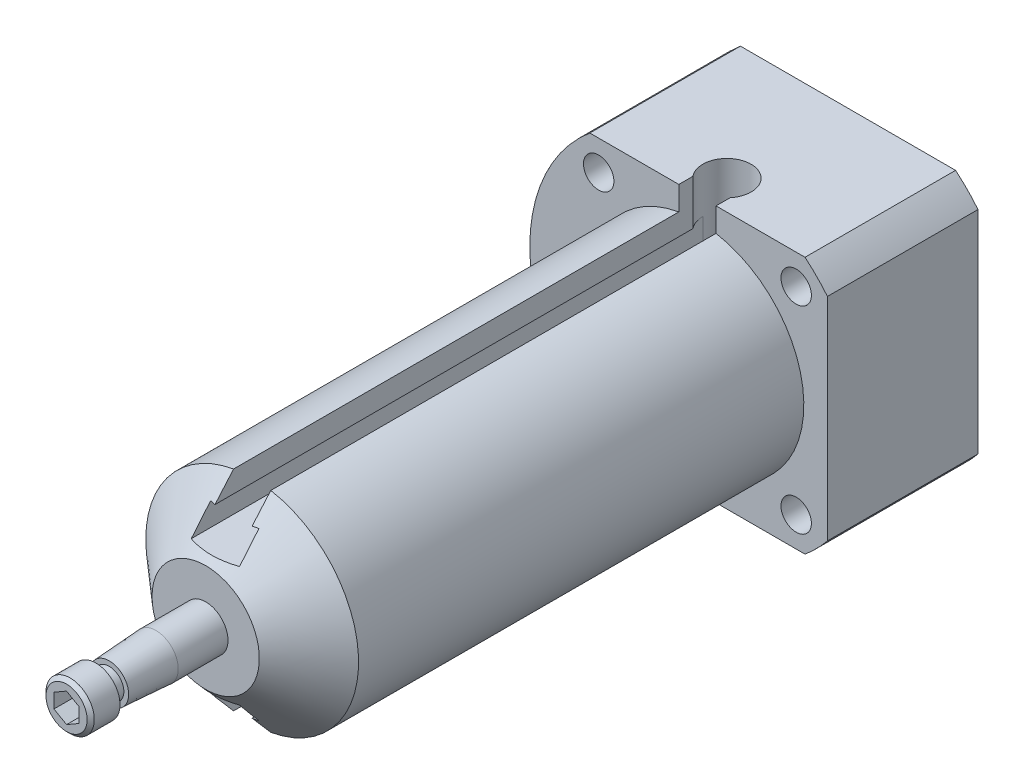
ISO-10303-21;
HEADER;
FILE_DESCRIPTION(('STEP AP214'),'2;1');
FILE_NAME('part.step','',(''),(''),'','','');
FILE_SCHEMA(('AUTOMOTIVE_DESIGN { 1 0 10303 214 1 1 1 1 }'));
ENDSEC;
DATA;
#1=APPLICATION_CONTEXT('core data for automotive mechanical design processes');
#2=APPLICATION_PROTOCOL_DEFINITION('international standard','automotive_design',2000,#1);
#3=PRODUCT_CONTEXT('',#1,'mechanical');
#4=PRODUCT('Part','Part','',(#3));
#5=PRODUCT_RELATED_PRODUCT_CATEGORY('part','',(#4));
#6=PRODUCT_DEFINITION_FORMATION('','',#4);
#7=PRODUCT_DEFINITION_CONTEXT('part definition',#1,'design');
#8=PRODUCT_DEFINITION('design','',#6,#7);
#9=PRODUCT_DEFINITION_SHAPE('','',#8);
#10=(LENGTH_UNIT() NAMED_UNIT(*) SI_UNIT(.MILLI.,.METRE.));
#11=(NAMED_UNIT(*) PLANE_ANGLE_UNIT() SI_UNIT($,.RADIAN.));
#12=(NAMED_UNIT(*) SI_UNIT($,.STERADIAN.) SOLID_ANGLE_UNIT());
#13=UNCERTAINTY_MEASURE_WITH_UNIT(LENGTH_MEASURE(1.E-05),#10,'distance_accuracy_value','');
#14=(GEOMETRIC_REPRESENTATION_CONTEXT(3) GLOBAL_UNCERTAINTY_ASSIGNED_CONTEXT((#13)) GLOBAL_UNIT_ASSIGNED_CONTEXT((#10,
#11,#12)) REPRESENTATION_CONTEXT('',''));
#15=CARTESIAN_POINT('',(0.,0.,0.));
#16=DIRECTION('',(0.,0.,1.));
#17=DIRECTION('',(1.,0.,0.));
#18=AXIS2_PLACEMENT_3D('',#15,#16,#17);
#19=CARTESIAN_POINT('',(0.,0.,91.2368));
#20=DIRECTION('',(0.,0.,-1.));
#21=DIRECTION('',(-1.,0.,0.));
#22=AXIS2_PLACEMENT_3D('',#19,#20,#21);
#23=CYLINDRICAL_SURFACE('',#22,23.8125);
#24=CARTESIAN_POINT('',(-19.9538993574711,12.995270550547,14.2748));
#25=CARTESIAN_POINT('',(-19.9539069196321,12.9952637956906,14.0427452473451));
#26=CARTESIAN_POINT('',(-19.9647073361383,12.9787215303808,13.8105680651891));
#27=CARTESIAN_POINT('',(-20.0073330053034,12.9129106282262,13.3527405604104));
#28=CARTESIAN_POINT('',(-20.0391770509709,12.863612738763,13.1270962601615));
#29=CARTESIAN_POINT('',(-20.1221023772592,12.7335015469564,12.6890259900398));
#30=CARTESIAN_POINT('',(-20.1731668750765,12.6527157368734,12.4765886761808));
#31=CARTESIAN_POINT('',(-20.2918487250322,12.4614861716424,12.0705726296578));
#32=CARTESIAN_POINT('',(-20.3594644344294,12.3510453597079,11.876992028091));
#33=CARTESIAN_POINT('',(-20.5086401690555,12.1017387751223,11.5120648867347));
#34=CARTESIAN_POINT('',(-20.5903292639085,11.962607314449,11.340952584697));
#35=CARTESIAN_POINT('',(-20.763345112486,11.6597177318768,11.0278562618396));
#36=CARTESIAN_POINT('',(-20.8546724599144,11.4959580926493,10.8858740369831));
#37=CARTESIAN_POINT('',(-21.0435573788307,11.1464570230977,10.6341818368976));
#38=CARTESIAN_POINT('',(-21.1411520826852,10.9605776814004,10.5246909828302));
#39=CARTESIAN_POINT('',(-21.3379393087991,10.5723603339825,10.3424992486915));
#40=CARTESIAN_POINT('',(-21.4371317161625,10.3700235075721,10.2697957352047));
#41=CARTESIAN_POINT('',(-21.6323041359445,9.95642050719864,10.1639619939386));
#42=CARTESIAN_POINT('',(-21.7283065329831,9.74526578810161,10.130437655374));
#43=CARTESIAN_POINT('',(-21.9149113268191,9.31805396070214,10.1026874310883));
#44=CARTESIAN_POINT('',(-22.0055141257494,9.10199721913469,10.1084586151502));
#45=CARTESIAN_POINT('',(-22.1778193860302,8.67365102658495,10.158830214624));
#46=CARTESIAN_POINT('',(-22.2596081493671,8.46134618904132,10.2030064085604));
#47=CARTESIAN_POINT('',(-22.4136904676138,8.04431998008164,10.3282649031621));
#48=CARTESIAN_POINT('',(-22.4859837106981,7.83959885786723,10.4093484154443));
#49=CARTESIAN_POINT('',(-22.6204360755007,7.44279364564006,10.6065347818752));
#50=CARTESIAN_POINT('',(-22.6825428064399,7.25077774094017,10.7228104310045));
#51=CARTESIAN_POINT('',(-22.795861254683,6.88624419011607,10.9869535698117));
#52=CARTESIAN_POINT('',(-22.8470720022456,6.71372828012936,11.134823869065));
#53=CARTESIAN_POINT('',(-22.9393731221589,6.39131175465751,11.460305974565));
#54=CARTESIAN_POINT('',(-22.9803191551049,6.24174404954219,11.6382887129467));
#55=CARTESIAN_POINT('',(-23.0516658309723,5.97287765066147,12.017699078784));
#56=CARTESIAN_POINT('',(-23.0820663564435,5.85357929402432,12.219126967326));
#57=CARTESIAN_POINT('',(-23.1329442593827,5.64917772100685,12.6401536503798));
#58=CARTESIAN_POINT('',(-23.1534084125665,5.56412010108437,12.8597762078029));
#59=CARTESIAN_POINT('',(-23.1848772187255,5.43151129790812,13.3107085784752));
#60=CARTESIAN_POINT('',(-23.195882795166,5.3839564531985,13.5420172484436));
#61=CARTESIAN_POINT('',(-23.2086838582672,5.32850444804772,14.0064996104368));
#62=CARTESIAN_POINT('',(-23.2105984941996,5.32009427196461,14.2396088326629));
#63=CARTESIAN_POINT('',(-23.2056007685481,5.34185072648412,14.7039159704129));
#64=CARTESIAN_POINT('',(-23.1986887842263,5.37201570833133,14.9351139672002));
#65=CARTESIAN_POINT('',(-23.1759090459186,5.46944645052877,15.3873658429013));
#66=CARTESIAN_POINT('',(-23.1601048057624,5.53644901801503,15.608479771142));
#67=CARTESIAN_POINT('',(-23.1191619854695,5.70499618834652,16.0361994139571));
#68=CARTESIAN_POINT('',(-23.0940227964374,5.80654304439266,16.2428041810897));
#69=CARTESIAN_POINT('',(-23.0335594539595,6.04194973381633,16.6379407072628));
#70=CARTESIAN_POINT('',(-22.9981348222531,6.17612611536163,16.8262684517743));
#71=CARTESIAN_POINT('',(-22.9166618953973,6.47188034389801,17.1773894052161));
#72=CARTESIAN_POINT('',(-22.8706127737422,6.63346032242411,17.3401806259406));
#73=CARTESIAN_POINT('',(-22.7669534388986,6.98098707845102,17.6375186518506));
#74=CARTESIAN_POINT('',(-22.7092161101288,7.16719320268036,17.7717183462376));
#75=CARTESIAN_POINT('',(-22.5825886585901,7.55670050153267,18.0056255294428));
#76=CARTESIAN_POINT('',(-22.5136989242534,7.76000108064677,18.1053342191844));
#77=CARTESIAN_POINT('',(-22.3658086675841,8.17644848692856,18.2668967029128));
#78=CARTESIAN_POINT('',(-22.286857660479,8.38954402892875,18.3289278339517));
#79=CARTESIAN_POINT('',(-22.1200412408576,8.81998690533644,18.4139435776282));
#80=CARTESIAN_POINT('',(-22.0321766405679,9.03733385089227,18.4369317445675));
#81=CARTESIAN_POINT('',(-21.8510102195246,9.46689662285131,18.4430984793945));
#82=CARTESIAN_POINT('',(-21.7577964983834,9.67914222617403,18.4268036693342));
#83=CARTESIAN_POINT('',(-21.5677698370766,10.0954861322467,18.3560115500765));
#84=CARTESIAN_POINT('',(-21.4709569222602,10.2995844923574,18.3015145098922));
#85=CARTESIAN_POINT('',(-21.2772921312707,10.6939342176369,18.1560747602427));
#86=CARTESIAN_POINT('',(-21.1804404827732,10.8842038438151,18.0651811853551));
#87=CARTESIAN_POINT('',(-20.990315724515,11.2464975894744,17.8495887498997));
#88=CARTESIAN_POINT('',(-20.897042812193,11.4185207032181,17.7248880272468));
#89=CARTESIAN_POINT('',(-20.7168309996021,11.7423544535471,17.4433747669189));
#90=CARTESIAN_POINT('',(-20.6299863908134,11.8938840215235,17.2861785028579));
#91=CARTESIAN_POINT('',(-20.467883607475,12.1707312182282,16.944938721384));
#92=CARTESIAN_POINT('',(-20.3926281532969,12.2960426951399,16.7608889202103));
#93=CARTESIAN_POINT('',(-20.2568521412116,12.5184768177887,16.3694368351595));
#94=CARTESIAN_POINT('',(-20.1964524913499,12.6153693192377,16.1618618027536));
#95=CARTESIAN_POINT('',(-20.0944017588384,12.7773006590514,15.730477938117));
#96=CARTESIAN_POINT('',(-20.0527323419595,12.8423706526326,15.5066852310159));
#97=CARTESIAN_POINT('',(-19.9992213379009,12.9254764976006,15.1142155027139));
#98=CARTESIAN_POINT('',(-19.982273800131,12.9516147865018,14.9478863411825));
#99=CARTESIAN_POINT('',(-19.9596101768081,12.9865140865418,14.6126597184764));
#100=CARTESIAN_POINT('',(-19.9538938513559,12.9952754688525,14.4437623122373));
#101=CARTESIAN_POINT('',(-19.9538993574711,12.995270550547,14.2748));
#102=B_SPLINE_CURVE_WITH_KNOTS('',3,(#24,#25,#26,#27,#28,#29,#30,#31,#32,#33,#34,#35,#36,#37,
#38,#39,#40,#41,#42,#43,#44,#45,#46,#47,#48,#49,#50,#51,#52,#53,#54,#55,#56,#57,#58,#59,#60,#61,
#62,#63,#64,#65,#66,#67,#68,#69,#70,#71,#72,#73,#74,#75,#76,#77,#78,#79,#80,#81,#82,#83,#84,#85,
#86,#87,#88,#89,#90,#91,#92,#93,#94,#95,#96,#97,#98,#99,#100,#101),.UNSPECIFIED.,.T.,.F.,(4,2,2,
2,2,2,2,2,2,2,2,2,2,2,2,2,2,2,2,2,2,2,2,2,2,2,2,2,2,2,2,2,2,2,2,2,2,2,4),(0.,0.695546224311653,
1.39171444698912,2.08727619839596,2.78276894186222,3.48501741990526,4.18730918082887,
4.89423482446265,5.60110985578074,6.30081136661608,7.00046070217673,7.6924785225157,
8.38451906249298,9.08001424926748,9.77557130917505,10.4804204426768,11.1852774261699,
11.8910699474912,12.5967935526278,13.2932416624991,13.9896600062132,14.6811661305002,
15.37271736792,16.0712657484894,16.7698684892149,17.4765219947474,18.1831508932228,
18.8864275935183,19.5896402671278,20.283478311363,20.9773114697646,21.6702111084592,
22.363148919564,23.0647917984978,23.7665991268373,24.4739421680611,25.1805913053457,
25.687039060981,26.1934759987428),.UNSPECIFIED.);
#103=CARTESIAN_POINT('',(-19.9538993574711,12.995270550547,14.2748));
#104=VERTEX_POINT('',#103);
#105=EDGE_CURVE('E517',#104,#104,#102,.T.);
#106=ORIENTED_EDGE('',*,*,#105,.F.);
#107=EDGE_LOOP('',(#106));
#108=FACE_BOUND('',#107,.T.);
#109=DIRECTION('',(0.,0.,-1.));
#110=VECTOR('',#109,1.);
#111=CARTESIAN_POINT('',(-15.2811189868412,-18.2626,91.2368));
#112=LINE('',#111,#110);
#113=CARTESIAN_POINT('',(-15.2811189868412,-18.2626,21.3868));
#114=VERTEX_POINT('',#113);
#115=CARTESIAN_POINT('',(-15.2811189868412,-18.2626,0.));
#116=VERTEX_POINT('',#115);
#117=EDGE_CURVE('E584',#114,#116,#112,.T.);
#118=ORIENTED_EDGE('',*,*,#117,.F.);
#119=CARTESIAN_POINT('',(0.,0.,21.3868));
#120=DIRECTION('',(0.,0.,-1.));
#121=DIRECTION('',(-1.,0.,0.));
#122=AXIS2_PLACEMENT_3D('',#119,#120,#121);
#123=CIRCLE('',#122,23.8125);
#124=CARTESIAN_POINT('',(-15.2811189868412,18.2626,21.3868));
#125=VERTEX_POINT('',#124);
#126=EDGE_CURVE('E587',#114,#125,#123,.T.);
#127=ORIENTED_EDGE('',*,*,#126,.T.);
#128=DIRECTION('',(0.,0.,-1.));
#129=VECTOR('',#128,1.);
#130=CARTESIAN_POINT('',(-15.2811189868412,18.2626,91.2368));
#131=LINE('',#130,#129);
#132=CARTESIAN_POINT('',(-15.2811189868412,18.2626,0.));
#133=VERTEX_POINT('',#132);
#134=EDGE_CURVE('E753',#125,#133,#131,.T.);
#135=ORIENTED_EDGE('',*,*,#134,.T.);
#136=CARTESIAN_POINT('',(0.,0.,0.));
#137=DIRECTION('',(0.,0.,1.));
#138=DIRECTION('',(1.,0.,0.));
#139=AXIS2_PLACEMENT_3D('',#136,#137,#138);
#140=CIRCLE('',#139,23.8125);
#141=EDGE_CURVE('E590',#133,#116,#140,.T.);
#142=ORIENTED_EDGE('',*,*,#141,.T.);
#143=EDGE_LOOP('',(#118,#127,#135,#142));
#144=FACE_BOUND('',#143,.T.);
#145=CARTESIAN_POINT('',(-19.9538993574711,-12.995270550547,14.2748));
#146=CARTESIAN_POINT('',(-19.9539069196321,-12.9952637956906,14.5068547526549));
#147=CARTESIAN_POINT('',(-19.9647073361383,-12.9787215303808,14.7390319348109));
#148=CARTESIAN_POINT('',(-20.0073330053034,-12.9129106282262,15.1968594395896));
#149=CARTESIAN_POINT('',(-20.0391770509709,-12.863612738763,15.4225037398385));
#150=CARTESIAN_POINT('',(-20.1221023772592,-12.7335015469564,15.8605740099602));
#151=CARTESIAN_POINT('',(-20.1731668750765,-12.6527157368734,16.0730113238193));
#152=CARTESIAN_POINT('',(-20.2918487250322,-12.4614861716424,16.4790273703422));
#153=CARTESIAN_POINT('',(-20.3594644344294,-12.3510453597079,16.672607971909));
#154=CARTESIAN_POINT('',(-20.5086401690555,-12.1017387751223,17.0375351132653));
#155=CARTESIAN_POINT('',(-20.5903292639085,-11.962607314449,17.208647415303));
#156=CARTESIAN_POINT('',(-20.763345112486,-11.6597177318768,17.5217437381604));
#157=CARTESIAN_POINT('',(-20.8546724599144,-11.4959580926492,17.6637259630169));
#158=CARTESIAN_POINT('',(-21.0435573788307,-11.1464570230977,17.9154181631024));
#159=CARTESIAN_POINT('',(-21.1411520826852,-10.9605776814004,18.0249090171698));
#160=CARTESIAN_POINT('',(-21.3379393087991,-10.5723603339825,18.2071007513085));
#161=CARTESIAN_POINT('',(-21.4371317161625,-10.3700235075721,18.2798042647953));
#162=CARTESIAN_POINT('',(-21.6323041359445,-9.95642050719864,18.3856380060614));
#163=CARTESIAN_POINT('',(-21.7283065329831,-9.74526578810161,18.419162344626));
#164=CARTESIAN_POINT('',(-21.9149113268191,-9.31805396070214,18.4469125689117));
#165=CARTESIAN_POINT('',(-22.0055141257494,-9.1019972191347,18.4411413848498));
#166=CARTESIAN_POINT('',(-22.1778193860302,-8.67365102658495,18.390769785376));
#167=CARTESIAN_POINT('',(-22.2596081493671,-8.46134618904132,18.3465935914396));
#168=CARTESIAN_POINT('',(-22.4136904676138,-8.04431998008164,18.2213350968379));
#169=CARTESIAN_POINT('',(-22.4859837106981,-7.83959885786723,18.1402515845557));
#170=CARTESIAN_POINT('',(-22.6204360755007,-7.44279364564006,17.9430652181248));
#171=CARTESIAN_POINT('',(-22.6825428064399,-7.25077774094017,17.8267895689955));
#172=CARTESIAN_POINT('',(-22.795861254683,-6.88624419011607,17.5626464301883));
#173=CARTESIAN_POINT('',(-22.8470720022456,-6.71372828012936,17.414776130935));
#174=CARTESIAN_POINT('',(-22.9393731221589,-6.39131175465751,17.089294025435));
#175=CARTESIAN_POINT('',(-22.9803191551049,-6.24174404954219,16.9113112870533));
#176=CARTESIAN_POINT('',(-23.0516658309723,-5.97287765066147,16.531900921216));
#177=CARTESIAN_POINT('',(-23.0820663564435,-5.85357929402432,16.330473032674));
#178=CARTESIAN_POINT('',(-23.1329442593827,-5.64917772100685,15.9094463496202));
#179=CARTESIAN_POINT('',(-23.1534084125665,-5.56412010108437,15.6898237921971));
#180=CARTESIAN_POINT('',(-23.1848772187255,-5.43151129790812,15.2388914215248));
#181=CARTESIAN_POINT('',(-23.195882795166,-5.3839564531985,15.0075827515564));
#182=CARTESIAN_POINT('',(-23.2086838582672,-5.32850444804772,14.5431003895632));
#183=CARTESIAN_POINT('',(-23.2105984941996,-5.32009427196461,14.3099911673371));
#184=CARTESIAN_POINT('',(-23.2056007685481,-5.34185072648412,13.8456840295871));
#185=CARTESIAN_POINT('',(-23.1986887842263,-5.37201570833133,13.6144860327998));
#186=CARTESIAN_POINT('',(-23.1759090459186,-5.46944645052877,13.1622341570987));
#187=CARTESIAN_POINT('',(-23.1601048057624,-5.53644901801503,12.941120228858));
#188=CARTESIAN_POINT('',(-23.1191619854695,-5.70499618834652,12.5134005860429));
#189=CARTESIAN_POINT('',(-23.0940227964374,-5.80654304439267,12.3067958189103));
#190=CARTESIAN_POINT('',(-23.0335594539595,-6.04194973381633,11.9116592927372));
#191=CARTESIAN_POINT('',(-22.9981348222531,-6.17612611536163,11.7233315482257));
#192=CARTESIAN_POINT('',(-22.9166618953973,-6.47188034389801,11.3722105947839));
#193=CARTESIAN_POINT('',(-22.8706127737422,-6.63346032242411,11.2094193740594));
#194=CARTESIAN_POINT('',(-22.7669534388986,-6.98098707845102,10.9120813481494));
#195=CARTESIAN_POINT('',(-22.7092161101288,-7.16719320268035,10.7778816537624));
#196=CARTESIAN_POINT('',(-22.5825886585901,-7.55670050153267,10.5439744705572));
#197=CARTESIAN_POINT('',(-22.5136989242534,-7.76000108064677,10.4442657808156));
#198=CARTESIAN_POINT('',(-22.3658086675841,-8.17644848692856,10.2827032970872));
#199=CARTESIAN_POINT('',(-22.286857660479,-8.38954402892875,10.2206721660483));
#200=CARTESIAN_POINT('',(-22.1200412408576,-8.81998690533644,10.1356564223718));
#201=CARTESIAN_POINT('',(-22.0321766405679,-9.03733385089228,10.1126682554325));
#202=CARTESIAN_POINT('',(-21.8510102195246,-9.46689662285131,10.1065015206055));
#203=CARTESIAN_POINT('',(-21.7577964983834,-9.67914222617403,10.1227963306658));
#204=CARTESIAN_POINT('',(-21.5677698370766,-10.0954861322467,10.1935884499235));
#205=CARTESIAN_POINT('',(-21.4709569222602,-10.2995844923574,10.2480854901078));
#206=CARTESIAN_POINT('',(-21.2772921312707,-10.6939342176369,10.3935252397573));
#207=CARTESIAN_POINT('',(-21.1804404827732,-10.8842038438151,10.4844188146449));
#208=CARTESIAN_POINT('',(-20.990315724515,-11.2464975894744,10.7000112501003));
#209=CARTESIAN_POINT('',(-20.897042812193,-11.4185207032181,10.8247119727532));
#210=CARTESIAN_POINT('',(-20.7168309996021,-11.7423544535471,11.1062252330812));
#211=CARTESIAN_POINT('',(-20.6299863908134,-11.8938840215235,11.2634214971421));
#212=CARTESIAN_POINT('',(-20.467883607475,-12.1707312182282,11.604661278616));
#213=CARTESIAN_POINT('',(-20.3926281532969,-12.2960426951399,11.7887110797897));
#214=CARTESIAN_POINT('',(-20.2568521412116,-12.5184768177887,12.1801631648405));
#215=CARTESIAN_POINT('',(-20.1964524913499,-12.6153693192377,12.3877381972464));
#216=CARTESIAN_POINT('',(-20.0944017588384,-12.7773006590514,12.819122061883));
#217=CARTESIAN_POINT('',(-20.0527323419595,-12.8423706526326,13.0429147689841));
#218=CARTESIAN_POINT('',(-19.9992213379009,-12.9254764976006,13.4353844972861));
#219=CARTESIAN_POINT('',(-19.982273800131,-12.9516147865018,13.6017136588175));
#220=CARTESIAN_POINT('',(-19.9596101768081,-12.9865140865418,13.9369402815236));
#221=CARTESIAN_POINT('',(-19.9538938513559,-12.9952754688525,14.1058376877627));
#222=CARTESIAN_POINT('',(-19.9538993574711,-12.995270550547,14.2748));
#223=B_SPLINE_CURVE_WITH_KNOTS('',3,(#145,#146,#147,#148,#149,#150,#151,#152,#153,#154,#155,
#156,#157,#158,#159,#160,#161,#162,#163,#164,#165,#166,#167,#168,#169,#170,#171,#172,#173,#174,
#175,#176,#177,#178,#179,#180,#181,#182,#183,#184,#185,#186,#187,#188,#189,#190,#191,#192,#193,
#194,#195,#196,#197,#198,#199,#200,#201,#202,#203,#204,#205,#206,#207,#208,#209,#210,#211,#212,
#213,#214,#215,#216,#217,#218,#219,#220,#221,#222),.UNSPECIFIED.,.T.,.F.,(4,2,2,2,2,2,2,2,2,2,2,
2,2,2,2,2,2,2,2,2,2,2,2,2,2,2,2,2,2,2,2,2,2,2,2,2,2,2,4),(0.,0.695546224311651,1.39171444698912,
2.08727619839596,2.78276894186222,3.48501741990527,4.18730918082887,4.89423482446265,
5.60110985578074,6.30081136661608,7.00046070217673,7.6924785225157,8.38451906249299,
9.08001424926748,9.77557130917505,10.4804204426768,11.1852774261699,11.8910699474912,
12.5967935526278,13.2932416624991,13.9896600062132,14.6811661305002,15.37271736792,
16.0712657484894,16.7698684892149,17.4765219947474,18.1831508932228,18.8864275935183,
19.5896402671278,20.283478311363,20.9773114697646,21.6702111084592,22.363148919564,
23.0647917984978,23.7665991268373,24.4739421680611,25.1805913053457,25.687039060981,
26.1934759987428),.UNSPECIFIED.);
#224=CARTESIAN_POINT('',(-19.9538993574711,-12.995270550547,14.2748));
#225=VERTEX_POINT('',#224);
#226=EDGE_CURVE('E510',#225,#225,#223,.T.);
#227=ORIENTED_EDGE('',*,*,#226,.F.);
#228=EDGE_LOOP('',(#227));
#229=FACE_BOUND('',#228,.T.);
#230=ADVANCED_FACE('F36',(#108,#144,#229),#23,.T.);
#231=CARTESIAN_POINT('',(-23.8125,0.,21.3868));
#232=DIRECTION('',(0.,0.,-1.));
#233=DIRECTION('',(-1.,0.,0.));
#234=AXIS2_PLACEMENT_3D('',#231,#232,#233);
#235=PLANE('',#234);
#236=CARTESIAN_POINT('',(-14.0271600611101,-14.0271600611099,21.3868));
#237=DIRECTION('',(0.,0.,1.));
#238=DIRECTION('',(1.,0.,0.));
#239=AXIS2_PLACEMENT_3D('',#236,#237,#238);
#240=CIRCLE('',#239,2.15900000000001);
#241=CARTESIAN_POINT('',(-11.8681600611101,-14.0271600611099,21.3868));
#242=VERTEX_POINT('',#241);
#243=EDGE_CURVE('E694',#242,#242,#240,.T.);
#244=ORIENTED_EDGE('',*,*,#243,.F.);
#245=EDGE_LOOP('',(#244));
#246=FACE_BOUND('',#245,.T.);
#247=CARTESIAN_POINT('',(14.02716006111,14.02716006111,21.3868));
#248=DIRECTION('',(0.,0.,1.));
#249=DIRECTION('',(1.,0.,0.));
#250=AXIS2_PLACEMENT_3D('',#247,#248,#249);
#251=CIRCLE('',#250,2.15900000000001);
#252=CARTESIAN_POINT('',(16.18616006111,14.02716006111,21.3868));
#253=VERTEX_POINT('',#252);
#254=EDGE_CURVE('E706',#253,#253,#251,.T.);
#255=ORIENTED_EDGE('',*,*,#254,.F.);
#256=EDGE_LOOP('',(#255));
#257=FACE_BOUND('',#256,.T.);
#258=DIRECTION('',(1.,0.,0.));
#259=VECTOR('',#258,1.);
#260=CARTESIAN_POINT('',(-15.2811189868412,18.2626,21.3868));
#261=LINE('',#260,#259);
#262=CARTESIAN_POINT('',(2.6416,18.2626,21.3868));
#263=VERTEX_POINT('',#262);
#264=CARTESIAN_POINT('',(15.2811189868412,18.2626,21.3868));
#265=VERTEX_POINT('',#264);
#266=EDGE_CURVE('E595',#263,#265,#261,.T.);
#267=ORIENTED_EDGE('',*,*,#266,.F.);
#268=DIRECTION('',(0.,-1.,0.));
#269=VECTOR('',#268,1.);
#270=CARTESIAN_POINT('',(2.64159999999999,0.,21.3868));
#271=LINE('',#270,#269);
#272=CARTESIAN_POINT('',(2.6416,14.8803467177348,21.3868));
#273=VERTEX_POINT('',#272);
#274=EDGE_CURVE('E680',#263,#273,#271,.T.);
#275=ORIENTED_EDGE('',*,*,#274,.T.);
#276=CARTESIAN_POINT('',(0.,0.,21.3868));
#277=DIRECTION('',(0.,0.,-1.));
#278=DIRECTION('',(-1.,0.,0.));
#279=AXIS2_PLACEMENT_3D('',#276,#277,#278);
#280=CIRCLE('',#279,15.113);
#281=CARTESIAN_POINT('',(-2.6416,14.8803467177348,21.3868));
#282=VERTEX_POINT('',#281);
#283=EDGE_CURVE('E727',#273,#282,#280,.T.);
#284=ORIENTED_EDGE('',*,*,#283,.T.);
#285=DIRECTION('',(0.,1.,0.));
#286=VECTOR('',#285,1.);
#287=CARTESIAN_POINT('',(-2.64159999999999,0.,21.3868));
#288=LINE('',#287,#286);
#289=CARTESIAN_POINT('',(-2.6416,18.2626,21.3868));
#290=VERTEX_POINT('',#289);
#291=EDGE_CURVE('E672',#282,#290,#288,.T.);
#292=ORIENTED_EDGE('',*,*,#291,.T.);
#293=EDGE_CURVE('E598',#125,#290,#261,.T.);
#294=ORIENTED_EDGE('',*,*,#293,.F.);
#295=ORIENTED_EDGE('',*,*,#126,.F.);
#296=DIRECTION('',(-1.,0.,0.));
#297=VECTOR('',#296,1.);
#298=CARTESIAN_POINT('',(-15.2811189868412,-18.2626,21.3868));
#299=LINE('',#298,#297);
#300=CARTESIAN_POINT('',(15.2811189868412,-18.2626,21.3868));
#301=VERTEX_POINT('',#300);
#302=EDGE_CURVE('E736',#301,#114,#299,.T.);
#303=ORIENTED_EDGE('',*,*,#302,.F.);
#304=CARTESIAN_POINT('',(18.4658,-15.0349388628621,21.3868));
#305=VERTEX_POINT('',#304);
#306=EDGE_CURVE('E731',#305,#301,#123,.T.);
#307=ORIENTED_EDGE('',*,*,#306,.F.);
#308=DIRECTION('',(0.,-1.,0.));
#309=VECTOR('',#308,1.);
#310=CARTESIAN_POINT('',(18.4658,15.0349388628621,21.3868));
#311=LINE('',#310,#309);
#312=CARTESIAN_POINT('',(18.4658,15.0349388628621,21.3868));
#313=VERTEX_POINT('',#312);
#314=EDGE_CURVE('E733',#313,#305,#311,.T.);
#315=ORIENTED_EDGE('',*,*,#314,.F.);
#316=EDGE_CURVE('E732',#265,#313,#123,.T.);
#317=ORIENTED_EDGE('',*,*,#316,.F.);
#318=EDGE_LOOP('',(#267,#275,#284,#292,#294,#295,#303,#307,#315,#317));
#319=FACE_BOUND('',#318,.T.);
#320=CARTESIAN_POINT('',(14.02716006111,-14.02716006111,21.3868));
#321=DIRECTION('',(0.,0.,1.));
#322=DIRECTION('',(1.,0.,0.));
#323=AXIS2_PLACEMENT_3D('',#320,#321,#322);
#324=CIRCLE('',#323,2.15900000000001);
#325=CARTESIAN_POINT('',(16.18616006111,-14.02716006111,21.3868));
#326=VERTEX_POINT('',#325);
#327=EDGE_CURVE('E700',#326,#326,#324,.T.);
#328=ORIENTED_EDGE('',*,*,#327,.F.);
#329=EDGE_LOOP('',(#328));
#330=FACE_BOUND('',#329,.T.);
#331=CARTESIAN_POINT('',(-14.0271600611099,14.0271600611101,21.3868));
#332=DIRECTION('',(0.,0.,1.));
#333=DIRECTION('',(1.,0.,0.));
#334=AXIS2_PLACEMENT_3D('',#331,#332,#333);
#335=CIRCLE('',#334,2.15900000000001);
#336=CARTESIAN_POINT('',(-11.8681600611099,14.0271600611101,21.3868));
#337=VERTEX_POINT('',#336);
#338=EDGE_CURVE('E522',#337,#337,#335,.T.);
#339=ORIENTED_EDGE('',*,*,#338,.F.);
#340=EDGE_LOOP('',(#339));
#341=FACE_BOUND('',#340,.T.);
#342=ADVANCED_FACE('F571',(#246,#257,#319,#330,#341),#235,.F.);
#343=CARTESIAN_POINT('',(-15.2811189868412,-18.2626,91.2368));
#344=DIRECTION('',(0.,1.,0.));
#345=DIRECTION('',(0.,0.,1.));
#346=AXIS2_PLACEMENT_3D('',#343,#344,#345);
#347=PLANE('',#346);
#348=DIRECTION('',(0.,0.,-1.));
#349=VECTOR('',#348,1.);
#350=CARTESIAN_POINT('',(15.2811189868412,-18.2626,91.2368));
#351=LINE('',#350,#349);
#352=CARTESIAN_POINT('',(15.2811189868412,-18.2626,0.));
#353=VERTEX_POINT('',#352);
#354=EDGE_CURVE('E596',#301,#353,#351,.T.);
#355=ORIENTED_EDGE('',*,*,#354,.F.);
#356=ORIENTED_EDGE('',*,*,#302,.T.);
#357=ORIENTED_EDGE('',*,*,#117,.T.);
#358=DIRECTION('',(1.,0.,0.));
#359=VECTOR('',#358,1.);
#360=CARTESIAN_POINT('',(-15.2811189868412,-18.2626,0.));
#361=LINE('',#360,#359);
#362=EDGE_CURVE('E739',#116,#353,#361,.T.);
#363=ORIENTED_EDGE('',*,*,#362,.T.);
#364=EDGE_LOOP('',(#355,#356,#357,#363));
#365=FACE_BOUND('',#364,.T.);
#366=ADVANCED_FACE('F576',(#365),#347,.F.);
#367=CARTESIAN_POINT('',(0.,0.,91.2368));
#368=DIRECTION('',(0.,0.,-1.));
#369=DIRECTION('',(-1.,0.,0.));
#370=AXIS2_PLACEMENT_3D('',#367,#368,#369);
#371=CYLINDRICAL_SURFACE('',#370,23.8125);
#372=DIRECTION('',(0.,0.,-1.));
#373=VECTOR('',#372,1.);
#374=CARTESIAN_POINT('',(18.4658,-15.0349388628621,91.2368));
#375=LINE('',#374,#373);
#376=CARTESIAN_POINT('',(18.4658,-15.0349388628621,0.));
#377=VERTEX_POINT('',#376);
#378=EDGE_CURVE('E599',#305,#377,#375,.T.);
#379=ORIENTED_EDGE('',*,*,#378,.F.);
#380=ORIENTED_EDGE('',*,*,#306,.T.);
#381=ORIENTED_EDGE('',*,*,#354,.T.);
#382=CARTESIAN_POINT('',(0.,0.,0.));
#383=DIRECTION('',(0.,0.,1.));
#384=DIRECTION('',(1.,0.,0.));
#385=AXIS2_PLACEMENT_3D('',#382,#383,#384);
#386=CIRCLE('',#385,23.8125);
#387=EDGE_CURVE('E741',#353,#377,#386,.T.);
#388=ORIENTED_EDGE('',*,*,#387,.T.);
#389=EDGE_LOOP('',(#379,#380,#381,#388));
#390=FACE_BOUND('',#389,.T.);
#391=ADVANCED_FACE('F767',(#390),#371,.T.);
#392=CARTESIAN_POINT('',(18.4658,15.0349388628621,91.2368));
#393=DIRECTION('',(-1.,0.,0.));
#394=DIRECTION('',(0.,0.,1.));
#395=AXIS2_PLACEMENT_3D('',#392,#393,#394);
#396=PLANE('',#395);
#397=DIRECTION('',(0.,0.,-1.));
#398=VECTOR('',#397,1.);
#399=CARTESIAN_POINT('',(18.4658,15.0349388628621,91.2368));
#400=LINE('',#399,#398);
#401=CARTESIAN_POINT('',(18.4658,15.0349388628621,0.));
#402=VERTEX_POINT('',#401);
#403=EDGE_CURVE('E757',#313,#402,#400,.T.);
#404=ORIENTED_EDGE('',*,*,#403,.F.);
#405=ORIENTED_EDGE('',*,*,#314,.T.);
#406=ORIENTED_EDGE('',*,*,#378,.T.);
#407=DIRECTION('',(0.,1.,0.));
#408=VECTOR('',#407,1.);
#409=CARTESIAN_POINT('',(18.4658,15.0349388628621,0.));
#410=LINE('',#409,#408);
#411=EDGE_CURVE('E744',#377,#402,#410,.T.);
#412=ORIENTED_EDGE('',*,*,#411,.T.);
#413=EDGE_LOOP('',(#404,#405,#406,#412));
#414=FACE_BOUND('',#413,.T.);
#415=ADVANCED_FACE('F761',(#414),#396,.F.);
#416=CARTESIAN_POINT('',(0.,0.,91.2368));
#417=DIRECTION('',(0.,0.,-1.));
#418=DIRECTION('',(-1.,0.,0.));
#419=AXIS2_PLACEMENT_3D('',#416,#417,#418);
#420=CYLINDRICAL_SURFACE('',#419,23.8125);
#421=DIRECTION('',(0.,0.,-1.));
#422=VECTOR('',#421,1.);
#423=CARTESIAN_POINT('',(15.2811189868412,18.2626,91.2368));
#424=LINE('',#423,#422);
#425=CARTESIAN_POINT('',(15.2811189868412,18.2626,0.));
#426=VERTEX_POINT('',#425);
#427=EDGE_CURVE('E755',#265,#426,#424,.T.);
#428=ORIENTED_EDGE('',*,*,#427,.F.);
#429=ORIENTED_EDGE('',*,*,#316,.T.);
#430=ORIENTED_EDGE('',*,*,#403,.T.);
#431=CARTESIAN_POINT('',(0.,0.,0.));
#432=DIRECTION('',(0.,0.,1.));
#433=DIRECTION('',(1.,0.,0.));
#434=AXIS2_PLACEMENT_3D('',#431,#432,#433);
#435=CIRCLE('',#434,23.8125);
#436=EDGE_CURVE('E747',#402,#426,#435,.T.);
#437=ORIENTED_EDGE('',*,*,#436,.T.);
#438=EDGE_LOOP('',(#428,#429,#430,#437));
#439=FACE_BOUND('',#438,.T.);
#440=ADVANCED_FACE('F774',(#439),#420,.T.);
#441=CARTESIAN_POINT('',(-15.2811189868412,18.2626,91.2368));
#442=DIRECTION('',(0.,-1.,0.));
#443=DIRECTION('',(0.,0.,-1.));
#444=AXIS2_PLACEMENT_3D('',#441,#442,#443);
#445=PLANE('',#444);
#446=DIRECTION('',(0.,0.,-1.));
#447=VECTOR('',#446,1.);
#448=CARTESIAN_POINT('',(-2.6416,18.2626,91.2368));
#449=LINE('',#448,#447);
#450=CARTESIAN_POINT('',(-2.6416,18.2626,19.3821189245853));
#451=VERTEX_POINT('',#450);
#452=EDGE_CURVE('E675',#290,#451,#449,.T.);
#453=ORIENTED_EDGE('',*,*,#452,.T.);
#454=CARTESIAN_POINT('',(0.,18.2626,17.1958));
#455=DIRECTION('',(0.,1.,0.));
#456=DIRECTION('',(0.,0.,1.));
#457=AXIS2_PLACEMENT_3D('',#454,#455,#456);
#458=CIRCLE('',#457,3.429);
#459=CARTESIAN_POINT('',(2.64159999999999,18.2626,19.3821189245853));
#460=VERTEX_POINT('',#459);
#461=EDGE_CURVE('E60',#460,#451,#458,.T.);
#462=ORIENTED_EDGE('',*,*,#461,.F.);
#463=DIRECTION('',(0.,0.,1.));
#464=VECTOR('',#463,1.);
#465=CARTESIAN_POINT('',(2.6416,18.2626,91.2368));
#466=LINE('',#465,#464);
#467=EDGE_CURVE('E683',#460,#263,#466,.T.);
#468=ORIENTED_EDGE('',*,*,#467,.T.);
#469=ORIENTED_EDGE('',*,*,#266,.T.);
#470=ORIENTED_EDGE('',*,*,#427,.T.);
#471=DIRECTION('',(-1.,0.,0.));
#472=VECTOR('',#471,1.);
#473=CARTESIAN_POINT('',(-15.2811189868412,18.2626,0.));
#474=LINE('',#473,#472);
#475=EDGE_CURVE('E750',#426,#133,#474,.T.);
#476=ORIENTED_EDGE('',*,*,#475,.T.);
#477=ORIENTED_EDGE('',*,*,#134,.F.);
#478=ORIENTED_EDGE('',*,*,#293,.T.);
#479=EDGE_LOOP('',(#453,#462,#468,#469,#470,#476,#477,#478));
#480=FACE_BOUND('',#479,.T.);
#481=ADVANCED_FACE('F824',(#480),#445,.F.);
#482=CARTESIAN_POINT('',(0.,0.,0.));
#483=DIRECTION('',(0.,0.,1.));
#484=DIRECTION('',(1.,0.,0.));
#485=AXIS2_PLACEMENT_3D('',#482,#483,#484);
#486=PLANE('',#485);
#487=CARTESIAN_POINT('',(-14.0271600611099,14.0271600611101,0.));
#488=DIRECTION('',(0.,0.,1.));
#489=DIRECTION('',(1.,0.,0.));
#490=AXIS2_PLACEMENT_3D('',#487,#488,#489);
#491=CIRCLE('',#490,2.15900000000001);
#492=CARTESIAN_POINT('',(-11.8681600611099,14.0271600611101,0.));
#493=VERTEX_POINT('',#492);
#494=EDGE_CURVE('E691',#493,#493,#491,.T.);
#495=ORIENTED_EDGE('',*,*,#494,.T.);
#496=EDGE_LOOP('',(#495));
#497=FACE_BOUND('',#496,.T.);
#498=CARTESIAN_POINT('',(-14.0271600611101,-14.0271600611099,0.));
#499=DIRECTION('',(0.,0.,1.));
#500=DIRECTION('',(1.,0.,0.));
#501=AXIS2_PLACEMENT_3D('',#498,#499,#500);
#502=CIRCLE('',#501,2.15900000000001);
#503=CARTESIAN_POINT('',(-11.8681600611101,-14.0271600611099,0.));
#504=VERTEX_POINT('',#503);
#505=EDGE_CURVE('E697',#504,#504,#502,.T.);
#506=ORIENTED_EDGE('',*,*,#505,.T.);
#507=EDGE_LOOP('',(#506));
#508=FACE_BOUND('',#507,.T.);
#509=CARTESIAN_POINT('',(14.02716006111,-14.02716006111,0.));
#510=DIRECTION('',(0.,0.,1.));
#511=DIRECTION('',(1.,0.,0.));
#512=AXIS2_PLACEMENT_3D('',#509,#510,#511);
#513=CIRCLE('',#512,2.15900000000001);
#514=CARTESIAN_POINT('',(16.18616006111,-14.02716006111,0.));
#515=VERTEX_POINT('',#514);
#516=EDGE_CURVE('E703',#515,#515,#513,.T.);
#517=ORIENTED_EDGE('',*,*,#516,.T.);
#518=EDGE_LOOP('',(#517));
#519=FACE_BOUND('',#518,.T.);
#520=CARTESIAN_POINT('',(14.02716006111,14.02716006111,0.));
#521=DIRECTION('',(0.,0.,1.));
#522=DIRECTION('',(1.,0.,0.));
#523=AXIS2_PLACEMENT_3D('',#520,#521,#522);
#524=CIRCLE('',#523,2.15900000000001);
#525=CARTESIAN_POINT('',(16.18616006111,14.02716006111,0.));
#526=VERTEX_POINT('',#525);
#527=EDGE_CURVE('E709',#526,#526,#524,.T.);
#528=ORIENTED_EDGE('',*,*,#527,.T.);
#529=EDGE_LOOP('',(#528));
#530=FACE_BOUND('',#529,.T.);
#531=ORIENTED_EDGE('',*,*,#141,.F.);
#532=ORIENTED_EDGE('',*,*,#475,.F.);
#533=ORIENTED_EDGE('',*,*,#436,.F.);
#534=ORIENTED_EDGE('',*,*,#411,.F.);
#535=ORIENTED_EDGE('',*,*,#387,.F.);
#536=ORIENTED_EDGE('',*,*,#362,.F.);
#537=EDGE_LOOP('',(#531,#532,#533,#534,#535,#536));
#538=FACE_BOUND('',#537,.T.);
#539=ADVANCED_FACE('F770',(#497,#508,#519,#530,#538),#486,.F.);
#540=CARTESIAN_POINT('',(0.,0.,0.));
#541=DIRECTION('',(0.,0.,-1.));
#542=DIRECTION('',(-1.,0.,0.));
#543=AXIS2_PLACEMENT_3D('',#540,#541,#542);
#544=CYLINDRICAL_SURFACE('',#543,15.113);
#545=DIRECTION('',(0.,0.,-1.));
#546=VECTOR('',#545,1.);
#547=CARTESIAN_POINT('',(2.64160000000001,-14.8803467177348,0.));
#548=LINE('',#547,#546);
#549=CARTESIAN_POINT('',(2.64160000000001,-14.8803467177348,84.6328));
#550=VERTEX_POINT('',#549);
#551=CARTESIAN_POINT('',(2.6416,-14.8803467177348,39.4481189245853));
#552=VERTEX_POINT('',#551);
#553=EDGE_CURVE('E645',#550,#552,#548,.T.);
#554=ORIENTED_EDGE('',*,*,#553,.T.);
#555=CARTESIAN_POINT('',(0.,-15.113,33.8328));
#556=CARTESIAN_POINT('',(-0.19000029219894,-15.112996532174,33.832806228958));
#557=CARTESIAN_POINT('',(-0.380074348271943,-15.1093807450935,33.848645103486));
#558=CARTESIAN_POINT('',(-0.754811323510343,-15.0953061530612,33.911509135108));
#559=CARTESIAN_POINT('',(-0.939470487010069,-15.0848427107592,33.9585554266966));
#560=CARTESIAN_POINT('',(-1.29790886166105,-15.0582362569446,34.0822752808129));
#561=CARTESIAN_POINT('',(-1.4716996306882,-15.0420994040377,34.1589167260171));
#562=CARTESIAN_POINT('',(-1.80395166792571,-15.0058819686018,34.3395465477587));
#563=CARTESIAN_POINT('',(-1.96241309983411,-14.9858014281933,34.4435346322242));
#564=CARTESIAN_POINT('',(-2.2622365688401,-14.9435055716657,34.6777966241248));
#565=CARTESIAN_POINT('',(-2.40329741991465,-14.9212621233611,34.8084509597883));
#566=CARTESIAN_POINT('',(-2.66170238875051,-14.8773427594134,35.0915204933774));
#567=CARTESIAN_POINT('',(-2.77904426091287,-14.8556668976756,35.2439377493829));
#568=CARTESIAN_POINT('',(-2.98803093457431,-14.8150581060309,35.5684612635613));
#569=CARTESIAN_POINT('',(-3.07935105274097,-14.7961611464,35.740781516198));
#570=CARTESIAN_POINT('',(-3.2316180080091,-14.7636552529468,36.0988226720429));
#571=CARTESIAN_POINT('',(-3.29256877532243,-14.75004563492,36.2845418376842));
#572=CARTESIAN_POINT('',(-3.38136343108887,-14.7299425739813,36.6608301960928));
#573=CARTESIAN_POINT('',(-3.40974270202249,-14.7233341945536,36.8512667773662));
#574=CARTESIAN_POINT('',(-3.43425425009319,-14.7176369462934,37.2343038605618));
#575=CARTESIAN_POINT('',(-3.43039080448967,-14.7185470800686,37.4269040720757));
#576=CARTESIAN_POINT('',(-3.39095650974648,-14.7276801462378,37.8047910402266));
#577=CARTESIAN_POINT('',(-3.3560115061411,-14.7357587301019,37.990147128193));
#578=CARTESIAN_POINT('',(-3.25639928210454,-14.7580897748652,38.3522952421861));
#579=CARTESIAN_POINT('',(-3.19173028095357,-14.7723426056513,38.5290867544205));
#580=CARTESIAN_POINT('',(-3.03394154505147,-14.8055560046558,38.8708263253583));
#581=CARTESIAN_POINT('',(-2.94058455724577,-14.8245555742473,39.0356608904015));
#582=CARTESIAN_POINT('',(-2.72823649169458,-14.8650982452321,39.3475546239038));
#583=CARTESIAN_POINT('',(-2.60924166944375,-14.8866417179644,39.4946111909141));
#584=CARTESIAN_POINT('',(-2.34570050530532,-14.9304612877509,39.7703737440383));
#585=CARTESIAN_POINT('',(-2.20062295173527,-14.9527427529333,39.8985717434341));
#586=CARTESIAN_POINT('',(-1.89077152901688,-14.9950713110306,40.1289046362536));
#587=CARTESIAN_POINT('',(-1.72599724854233,-15.0151183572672,40.231038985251));
#588=CARTESIAN_POINT('',(-1.38078370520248,-15.05079237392,40.4064858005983));
#589=CARTESIAN_POINT('',(-1.20030741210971,-15.0664085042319,40.4797277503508));
#590=CARTESIAN_POINT('',(-0.829174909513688,-15.0913811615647,40.5947016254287));
#591=CARTESIAN_POINT('',(-0.63852030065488,-15.1007386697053,40.6364384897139));
#592=CARTESIAN_POINT('',(-0.256796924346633,-15.1119987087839,40.686469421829));
#593=CARTESIAN_POINT('',(-0.0658234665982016,-15.1140557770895,40.6954568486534));
#594=CARTESIAN_POINT('',(0.314896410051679,-15.1109179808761,40.6816186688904));
#595=CARTESIAN_POINT('',(0.504642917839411,-15.1057236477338,40.6587953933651));
#596=CARTESIAN_POINT('',(0.875197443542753,-15.0887646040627,40.5825579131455));
#597=CARTESIAN_POINT('',(1.05608496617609,-15.077078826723,40.529511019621));
#598=CARTESIAN_POINT('',(1.40639251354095,-15.0484465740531,40.3947427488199));
#599=CARTESIAN_POINT('',(1.57581151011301,-15.0314996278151,40.3130188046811));
#600=CARTESIAN_POINT('',(1.9012131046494,-14.9938460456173,40.1217969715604));
#601=CARTESIAN_POINT('',(2.05695281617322,-14.9730862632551,40.0118964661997));
#602=CARTESIAN_POINT('',(2.34802782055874,-14.9302115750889,39.7679673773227));
#603=CARTESIAN_POINT('',(2.48336024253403,-14.9080964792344,39.6339354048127));
#604=CARTESIAN_POINT('',(2.73254980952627,-14.8644641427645,39.3423559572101));
#605=CARTESIAN_POINT('',(2.84592511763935,-14.8429676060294,39.1843930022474));
#606=CARTESIAN_POINT('',(3.04454366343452,-14.8035069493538,38.8512635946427));
#607=CARTESIAN_POINT('',(3.12978814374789,-14.7855426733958,38.6760979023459));
#608=CARTESIAN_POINT('',(3.26912960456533,-14.7553599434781,38.314487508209));
#609=CARTESIAN_POINT('',(3.3234059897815,-14.743108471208,38.128114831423));
#610=CARTESIAN_POINT('',(3.39978551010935,-14.7256847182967,37.7485779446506));
#611=CARTESIAN_POINT('',(3.42189424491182,-14.7205112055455,37.5554149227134));
#612=CARTESIAN_POINT('',(3.43305862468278,-14.7179109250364,37.1726492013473));
#613=CARTESIAN_POINT('',(3.42287962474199,-14.7203047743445,36.9830696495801));
#614=CARTESIAN_POINT('',(3.37147860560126,-14.7321615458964,36.6084036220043));
#615=CARTESIAN_POINT('',(3.33025701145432,-14.7416243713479,36.4233170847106));
#616=CARTESIAN_POINT('',(3.21832322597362,-14.7664622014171,36.0635548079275));
#617=CARTESIAN_POINT('',(3.14773046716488,-14.7818132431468,35.8888401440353));
#618=CARTESIAN_POINT('',(2.97915796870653,-14.8167055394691,35.5536233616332));
#619=CARTESIAN_POINT('',(2.88117512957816,-14.8362472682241,35.3931228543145));
#620=CARTESIAN_POINT('',(2.65810012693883,-14.8778488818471,35.0871356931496));
#621=CARTESIAN_POINT('',(2.53246601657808,-14.8999541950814,34.9420502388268));
#622=CARTESIAN_POINT('',(2.25874282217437,-14.9438959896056,34.6747705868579));
#623=CARTESIAN_POINT('',(2.11064852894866,-14.965732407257,34.5525817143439));
#624=CARTESIAN_POINT('',(1.7936739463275,-15.0070443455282,34.332894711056));
#625=CARTESIAN_POINT('',(1.62452845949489,-15.0264819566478,34.2357716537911));
#626=CARTESIAN_POINT('',(1.2719017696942,-15.0604216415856,34.0714905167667));
#627=CARTESIAN_POINT('',(1.08843230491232,-15.0749277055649,34.0043081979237));
#628=CARTESIAN_POINT('',(0.754080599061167,-15.0948902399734,33.9132987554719));
#629=CARTESIAN_POINT('',(0.60495824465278,-15.10163822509,33.8831711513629));
#630=CARTESIAN_POINT('',(0.303906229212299,-15.1106943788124,33.8429197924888));
#631=CARTESIAN_POINT('',(0.151976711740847,-15.1130027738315,33.8327950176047));
#632=CARTESIAN_POINT('',(0.,-15.113,33.8328));
#633=B_SPLINE_CURVE_WITH_KNOTS('',3,(#555,#556,#557,#558,#559,#560,#561,#562,#563,#564,#565,
#566,#567,#568,#569,#570,#571,#572,#573,#574,#575,#576,#577,#578,#579,#580,#581,#582,#583,#584,
#585,#586,#587,#588,#589,#590,#591,#592,#593,#594,#595,#596,#597,#598,#599,#600,#601,#602,#603,
#604,#605,#606,#607,#608,#609,#610,#611,#612,#613,#614,#615,#616,#617,#618,#619,#620,#621,#622,
#623,#624,#625,#626,#627,#628,#629,#630,#631,#632),.UNSPECIFIED.,.T.,.F.,(4,2,2,2,2,2,2,2,2,2,2,
2,2,2,2,2,2,2,2,2,2,2,2,2,2,2,2,2,2,2,2,2,2,2,2,2,2,2,4),(0.,0.569444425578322,1.1392748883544,
1.70848868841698,2.27769640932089,2.85567704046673,3.43371236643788,4.01867238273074,
4.6035566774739,5.17868288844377,5.75373280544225,6.31745946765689,6.88121990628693,
7.44977424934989,8.01841168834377,8.60031152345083,9.18222351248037,9.76554709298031,
10.3487792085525,10.9195891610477,11.4903572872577,12.0543324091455,12.6183580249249,
13.1909419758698,13.763606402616,14.3476857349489,14.93173926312,15.5123739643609,
16.092907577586,16.659783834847,17.2266523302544,17.7912379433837,18.3558874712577,
18.932785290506,19.5098171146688,20.0950392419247,20.6797867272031,21.1352950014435,
21.5907800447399),.UNSPECIFIED.);
#634=CARTESIAN_POINT('',(-2.6416,-14.8803467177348,39.4481189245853));
#635=VERTEX_POINT('',#634);
#636=EDGE_CURVE('E315',#552,#635,#633,.T.);
#637=ORIENTED_EDGE('',*,*,#636,.T.);
#638=DIRECTION('',(0.,0.,-1.));
#639=VECTOR('',#638,1.);
#640=CARTESIAN_POINT('',(-2.64160000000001,-14.8803467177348,0.));
#641=LINE('',#640,#639);
#642=CARTESIAN_POINT('',(-2.6416,-14.8803467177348,84.6328));
#643=VERTEX_POINT('',#642);
#644=EDGE_CURVE('E643',#635,#643,#641,.F.);
#645=ORIENTED_EDGE('',*,*,#644,.T.);
#646=CARTESIAN_POINT('',(0.,0.,84.6328));
#647=DIRECTION('',(0.,0.,-1.));
#648=DIRECTION('',(-1.,0.,0.));
#649=AXIS2_PLACEMENT_3D('',#646,#647,#648);
#650=CIRCLE('',#649,15.113);
#651=CARTESIAN_POINT('',(-2.6416,14.8803467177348,84.6328));
#652=VERTEX_POINT('',#651);
#653=EDGE_CURVE('E723',#643,#652,#650,.T.);
#654=ORIENTED_EDGE('',*,*,#653,.T.);
#655=DIRECTION('',(0.,0.,-1.));
#656=VECTOR('',#655,1.);
#657=CARTESIAN_POINT('',(-2.6416,14.8803467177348,0.));
#658=LINE('',#657,#656);
#659=EDGE_CURVE('E656',#652,#282,#658,.T.);
#660=ORIENTED_EDGE('',*,*,#659,.T.);
#661=ORIENTED_EDGE('',*,*,#283,.F.);
#662=DIRECTION('',(0.,0.,-1.));
#663=VECTOR('',#662,1.);
#664=CARTESIAN_POINT('',(2.6416,14.8803467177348,0.));
#665=LINE('',#664,#663);
#666=CARTESIAN_POINT('',(2.6416,14.8803467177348,84.6328));
#667=VERTEX_POINT('',#666);
#668=EDGE_CURVE('E677',#273,#667,#665,.F.);
#669=ORIENTED_EDGE('',*,*,#668,.T.);
#670=EDGE_CURVE('E724',#667,#550,#650,.T.);
#671=ORIENTED_EDGE('',*,*,#670,.T.);
#672=EDGE_LOOP('',(#554,#637,#645,#654,#660,#661,#669,#671));
#673=FACE_BOUND('',#672,.T.);
#674=ADVANCED_FACE('F324',(#673),#544,.T.);
#675=CARTESIAN_POINT('',(0.,0.,91.2368));
#676=DIRECTION('',(0.,0.,-1.));
#677=DIRECTION('',(-1.,0.,0.));
#678=AXIS2_PLACEMENT_3D('',#675,#676,#677);
#679=CONICAL_SURFACE('',#678,7.61999999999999,0.848377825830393);
#680=CARTESIAN_POINT('',(7.41966530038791,-11.8237,85.6499594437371));
#681=CARTESIAN_POINT('',(7.19031716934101,-11.8237,85.7573875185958));
#682=CARTESIAN_POINT('',(6.95958745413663,-11.8237,85.8619181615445));
#683=CARTESIAN_POINT('',(6.49515054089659,-11.8237,86.0643552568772));
#684=CARTESIAN_POINT('',(6.26144235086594,-11.8237,86.16225942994));
#685=CARTESIAN_POINT('',(5.79006211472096,-11.8237,86.3509112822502));
#686=CARTESIAN_POINT('',(5.55237806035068,-11.8237,86.441629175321));
#687=CARTESIAN_POINT('',(5.07395237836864,-11.8237,86.6144651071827));
#688=CARTESIAN_POINT('',(4.8332110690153,-11.8237,86.6965840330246));
#689=CARTESIAN_POINT('',(4.11957438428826,-11.8237,86.9242245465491));
#690=CARTESIAN_POINT('',(3.64221693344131,-11.8237,87.056353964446));
#691=CARTESIAN_POINT('',(2.91904570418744,-11.8237,87.2209259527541));
#692=CARTESIAN_POINT('',(2.67697231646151,-11.8237,87.2701567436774));
#693=CARTESIAN_POINT('',(2.19069425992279,-11.8237,87.3565624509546));
#694=CARTESIAN_POINT('',(1.94648994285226,-11.8237,87.3937393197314));
#695=CARTESIAN_POINT('',(1.45045782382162,-11.8237,87.4560092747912));
#696=CARTESIAN_POINT('',(1.19858981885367,-11.8237,87.4807840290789));
#697=CARTESIAN_POINT('',(0.693829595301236,-11.8237,87.5162726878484));
#698=CARTESIAN_POINT('',(0.440937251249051,-11.8237,87.5269848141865));
#699=CARTESIAN_POINT('',(-0.0685866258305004,-11.8237,87.5341200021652));
#700=CARTESIAN_POINT('',(-0.325221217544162,-11.8237,87.530342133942));
#701=CARTESIAN_POINT('',(-0.709665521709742,-11.8237,87.5137011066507));
#702=CARTESIAN_POINT('',(-0.837735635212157,-11.8237,87.506324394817));
#703=CARTESIAN_POINT('',(-1.0936160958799,-11.8237,87.4879671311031));
#704=CARTESIAN_POINT('',(-1.22142644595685,-11.8237,87.4769866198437));
#705=CARTESIAN_POINT('',(-1.34906530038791,-11.8237,87.4642315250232));
#706=B_SPLINE_CURVE_WITH_KNOTS('',3,(#680,#681,#682,#683,#684,#685,#686,#687,#688,#689,#690,
#691,#692,#693,#694,#695,#696,#697,#698,#699,#700,#701,#702,#703,#704,#705),.UNSPECIFIED.,.F.,
.F.,(4,2,2,2,2,2,2,2,2,2,2,2,4),(0.,0.759794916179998,1.51984986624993,2.28290612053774,
3.04588358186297,4.52965387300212,5.2704970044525,6.01122007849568,6.77008894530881,
7.5290537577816,8.298580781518,8.68338409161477,9.06818306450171),.UNSPECIFIED.);
#707=CARTESIAN_POINT('',(3.429,-11.8237,87.1024594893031));
#708=VERTEX_POINT('',#707);
#709=CARTESIAN_POINT('',(2.64160000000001,-11.8237,87.2749338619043));
#710=VERTEX_POINT('',#709);
#711=EDGE_CURVE('E351',#708,#710,#706,.T.);
#712=ORIENTED_EDGE('',*,*,#711,.T.);
#713=CARTESIAN_POINT('',(2.64160000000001,-2.79029016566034,94.5662409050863));
#714=CARTESIAN_POINT('',(2.64160000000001,-2.86767274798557,94.5167056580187));
#715=CARTESIAN_POINT('',(2.64160000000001,-2.94461708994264,94.4664936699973));
#716=CARTESIAN_POINT('',(2.64160000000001,-3.09772835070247,94.3649079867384));
#717=CARTESIAN_POINT('',(2.64160000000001,-3.17389532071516,94.3135343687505));
#718=CARTESIAN_POINT('',(2.64160000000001,-3.40135505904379,94.1579753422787));
#719=CARTESIAN_POINT('',(2.64160000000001,-3.55164631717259,94.0523261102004));
#720=CARTESIAN_POINT('',(2.64160000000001,-3.85007376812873,93.838241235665));
#721=CARTESIAN_POINT('',(2.64160000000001,-3.99821127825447,93.7298074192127));
#722=CARTESIAN_POINT('',(2.64160000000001,-4.29289218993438,93.5107761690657));
#723=CARTESIAN_POINT('',(2.64160000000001,-4.43943547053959,93.4001785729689));
#724=CARTESIAN_POINT('',(2.64160000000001,-4.73111876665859,93.1774222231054));
#725=CARTESIAN_POINT('',(2.64160000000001,-4.87625992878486,93.0652649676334));
#726=CARTESIAN_POINT('',(2.64160000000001,-5.16552181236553,92.8396411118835));
#727=CARTESIAN_POINT('',(2.64160000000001,-5.30964252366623,92.7261744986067));
#728=CARTESIAN_POINT('',(2.64160000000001,-5.74082320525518,92.3841737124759));
#729=CARTESIAN_POINT('',(2.64160000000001,-6.02664642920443,92.1540811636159));
#730=CARTESIAN_POINT('',(2.64160000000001,-6.64306013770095,91.6529196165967));
#731=CARTESIAN_POINT('',(2.64160000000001,-6.97324905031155,91.381358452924));
#732=CARTESIAN_POINT('',(2.64160000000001,-7.63156361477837,90.8357444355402));
#733=CARTESIAN_POINT('',(2.64160000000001,-7.95968924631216,90.5616915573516));
#734=CARTESIAN_POINT('',(2.64160000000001,-8.61445797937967,90.0118635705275));
#735=CARTESIAN_POINT('',(2.64160000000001,-8.94110117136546,89.7360885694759));
#736=CARTESIAN_POINT('',(2.64160000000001,-9.59331454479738,89.1832718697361));
#737=CARTESIAN_POINT('',(2.64160000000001,-9.91888472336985,88.9062301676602));
#738=CARTESIAN_POINT('',(2.64160000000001,-10.8949752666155,88.0732143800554));
#739=CARTESIAN_POINT('',(2.64160000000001,-11.5442976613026,87.5158371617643));
#740=CARTESIAN_POINT('',(2.64160000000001,-12.8410228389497,86.3988507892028));
#741=CARTESIAN_POINT('',(2.64160000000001,-13.4884256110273,85.8392416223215));
#742=CARTESIAN_POINT('',(2.64160000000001,-15.0589813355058,84.4785930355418));
#743=CARTESIAN_POINT('',(2.64160000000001,-15.9814819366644,83.6768008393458));
#744=CARTESIAN_POINT('',(2.64160000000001,-17.8249767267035,82.0714910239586));
#745=CARTESIAN_POINT('',(2.64160000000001,-18.7459709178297,81.2679734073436));
#746=CARTESIAN_POINT('',(2.64160000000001,-20.5856206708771,79.6610243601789));
#747=CARTESIAN_POINT('',(2.64160000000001,-21.5042776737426,78.8575945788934));
#748=CARTESIAN_POINT('',(2.64160000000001,-23.3409109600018,77.249958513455));
#749=CARTESIAN_POINT('',(2.64160000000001,-24.2588872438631,76.4457522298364));
#750=CARTESIAN_POINT('',(2.64160000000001,-25.1766667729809,75.6413221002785));
#751=B_SPLINE_CURVE_WITH_KNOTS('',3,(#713,#714,#715,#716,#717,#718,#719,#720,#721,#722,#723,
#724,#725,#726,#727,#728,#729,#730,#731,#732,#733,#734,#735,#736,#737,#738,#739,#740,#741,#742,
#743,#744,#745,#746,#747,#748,#749,#750),.UNSPECIFIED.,.F.,.F.,(4,2,2,2,2,2,2,2,2,2,2,2,2,2,2,2,
2,2,4),(0.,0.275627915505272,0.551237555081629,1.10231518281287,1.65304022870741,
2.20380676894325,2.75407647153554,3.30435164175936,4.40511130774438,5.68764353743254,
6.97018837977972,8.25265388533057,9.5351228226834,12.102329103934,14.6695499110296,
18.3362746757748,22.0029939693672,25.6642597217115,29.3255229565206),.UNSPECIFIED.);
#752=EDGE_CURVE('E358',#710,#550,#751,.T.);
#753=ORIENTED_EDGE('',*,*,#752,.T.);
#754=ORIENTED_EDGE('',*,*,#670,.F.);
#755=CARTESIAN_POINT('',(2.6416,24.240582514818,76.4616689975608));
#756=CARTESIAN_POINT('',(2.6416,23.3215744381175,77.2668183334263));
#757=CARTESIAN_POINT('',(2.6416,22.402351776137,78.0717236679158));
#758=CARTESIAN_POINT('',(2.6416,20.5633190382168,79.6804840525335));
#759=CARTESIAN_POINT('',(2.6416,19.6435091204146,80.4843392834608));
#760=CARTESIAN_POINT('',(2.6416,18.263222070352,81.6889253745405));
#761=CARTESIAN_POINT('',(2.6416,17.8031652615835,82.0901377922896));
#762=CARTESIAN_POINT('',(2.6416,16.8826965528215,82.8921500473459));
#763=CARTESIAN_POINT('',(2.6416,16.4222846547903,83.292949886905));
#764=CARTESIAN_POINT('',(2.6416,15.5009185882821,84.0941039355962));
#765=CARTESIAN_POINT('',(2.6416,15.0399643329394,84.4944580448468));
#766=CARTESIAN_POINT('',(2.6416,14.1174542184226,85.2944913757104));
#767=CARTESIAN_POINT('',(2.64159999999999,13.6558983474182,85.6941705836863));
#768=CARTESIAN_POINT('',(2.64159999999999,12.7314359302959,86.49309663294));
#769=CARTESIAN_POINT('',(2.64159999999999,12.2685284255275,86.8923423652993));
#770=CARTESIAN_POINT('',(2.64159999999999,11.3416544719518,87.6895364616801));
#771=CARTESIAN_POINT('',(2.64159999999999,10.8776881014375,88.087484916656));
#772=CARTESIAN_POINT('',(2.64159999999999,9.94846615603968,88.8813155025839));
#773=CARTESIAN_POINT('',(2.64159999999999,9.48321150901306,89.2771987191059));
#774=CARTESIAN_POINT('',(2.64159999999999,8.55025390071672,90.0663218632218));
#775=CARTESIAN_POINT('',(2.64159999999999,8.08255034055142,90.4595610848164));
#776=CARTESIAN_POINT('',(2.64159999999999,7.37769487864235,91.0464443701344));
#777=CARTESIAN_POINT('',(2.64159999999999,7.14194866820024,91.2417757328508));
#778=CARTESIAN_POINT('',(2.64159999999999,6.66922695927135,91.6309174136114));
#779=CARTESIAN_POINT('',(2.64159999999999,6.43225153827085,91.8247278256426));
#780=CARTESIAN_POINT('',(2.64159999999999,5.95684042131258,92.2101513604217));
#781=CARTESIAN_POINT('',(2.64159999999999,5.71840608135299,92.4017661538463));
#782=CARTESIAN_POINT('',(2.64159999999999,5.23921910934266,92.7822015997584));
#783=CARTESIAN_POINT('',(2.64159999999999,4.998465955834,92.9710215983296));
#784=CARTESIAN_POINT('',(2.64159999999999,4.63455656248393,93.2514008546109));
#785=CARTESIAN_POINT('',(2.64159999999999,4.51260500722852,93.3445231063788));
#786=CARTESIAN_POINT('',(2.64159999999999,4.26771792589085,93.5294606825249));
#787=CARTESIAN_POINT('',(2.64159999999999,4.14478242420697,93.6212760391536));
#788=CARTESIAN_POINT('',(2.64159999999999,3.89779038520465,93.8032184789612));
#789=CARTESIAN_POINT('',(2.64159999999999,3.77373463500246,93.8933466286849));
#790=CARTESIAN_POINT('',(2.64159999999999,3.52413022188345,94.0715442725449));
#791=CARTESIAN_POINT('',(2.64159999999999,3.39858141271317,94.1596135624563));
#792=CARTESIAN_POINT('',(2.64159999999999,3.14524262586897,94.3333469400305));
#793=CARTESIAN_POINT('',(2.64159999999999,3.01744682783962,94.419002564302));
#794=CARTESIAN_POINT('',(2.64159999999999,2.75955906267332,94.5867338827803));
#795=CARTESIAN_POINT('',(2.64159999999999,2.62946775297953,94.6688105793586));
#796=CARTESIAN_POINT('',(2.64159999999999,2.43198427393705,94.7883923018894));
#797=CARTESIAN_POINT('',(2.64159999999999,2.36568756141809,94.82770727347));
#798=CARTESIAN_POINT('',(2.64159999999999,2.23226915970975,94.9049042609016));
#799=CARTESIAN_POINT('',(2.64159999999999,2.16514752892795,94.942786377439));
#800=CARTESIAN_POINT('',(2.64159999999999,2.02991483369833,95.0169049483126));
#801=CARTESIAN_POINT('',(2.64159999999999,1.96180289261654,95.0531398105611));
#802=CARTESIAN_POINT('',(2.64159999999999,1.82453289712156,95.1236099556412));
#803=CARTESIAN_POINT('',(2.64159999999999,1.75537458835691,95.1578447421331));
#804=CARTESIAN_POINT('',(2.64159999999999,1.68565043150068,95.1909125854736));
#805=B_SPLINE_CURVE_WITH_KNOTS('',3,(#755,#756,#757,#758,#759,#760,#761,#762,#763,#764,#765,
#766,#767,#768,#769,#770,#771,#772,#773,#774,#775,#776,#777,#778,#779,#780,#781,#782,#783,#784,
#785,#786,#787,#788,#789,#790,#791,#792,#793,#794,#795,#796,#797,#798,#799,#800,#801,#802,#803,
#804),.UNSPECIFIED.,.F.,.F.,(4,2,2,2,2,2,2,2,2,2,2,2,2,2,2,2,2,2,2,2,2,2,2,2,4),(0.,
3.66545749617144,7.33016704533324,9.16145411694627,10.9927311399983,12.8243583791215,
14.6560221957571,16.489903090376,18.3236525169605,20.1563143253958,21.989447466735,
22.907906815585,23.8263089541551,24.7439583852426,25.6618192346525,26.1221336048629,
26.5824365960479,27.0424380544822,27.5024849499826,27.963983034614,28.4253510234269,
28.656568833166,28.8877703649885,29.1191908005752,29.35066842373),.UNSPECIFIED.);
#806=CARTESIAN_POINT('',(2.64159999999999,11.8237,87.2749338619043));
#807=VERTEX_POINT('',#806);
#808=EDGE_CURVE('E423',#667,#807,#805,.T.);
#809=ORIENTED_EDGE('',*,*,#808,.T.);
#810=CARTESIAN_POINT('',(-1.34906530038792,11.8237,87.4642315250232));
#811=CARTESIAN_POINT('',(-1.15560165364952,11.8237,87.4835818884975));
#812=CARTESIAN_POINT('',(-0.961723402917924,11.8237,87.498828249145));
#813=CARTESIAN_POINT('',(-0.573492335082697,11.8237,87.5209846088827));
#814=CARTESIAN_POINT('',(-0.37913951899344,11.8237,87.5278946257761));
#815=CARTESIAN_POINT('',(0.00946679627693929,11.8237,87.5332469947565));
#816=CARTESIAN_POINT('',(0.203720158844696,11.8237,87.5316989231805));
#817=CARTESIAN_POINT('',(0.591962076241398,11.8237,87.5201943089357));
#818=CARTESIAN_POINT('',(0.785950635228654,11.8237,87.5102378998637));
#819=CARTESIAN_POINT('',(1.3597820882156,11.8237,87.4684612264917));
#820=CARTESIAN_POINT('',(1.73882196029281,11.8237,87.424821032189));
#821=CARTESIAN_POINT('',(2.4922230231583,11.8237,87.307889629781));
#822=CARTESIAN_POINT('',(2.86658368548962,11.8237,87.2345951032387));
#823=CARTESIAN_POINT('',(3.59569829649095,11.8237,87.064873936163));
#824=CARTESIAN_POINT('',(3.95067179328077,11.8237,86.9693793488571));
#825=CARTESIAN_POINT('',(4.65431848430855,11.8237,86.7573206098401));
#826=CARTESIAN_POINT('',(5.0029897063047,11.8237,86.6407499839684));
#827=CARTESIAN_POINT('',(5.70039744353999,11.8237,86.3874240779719));
#828=CARTESIAN_POINT('',(6.04900905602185,11.8237,86.2503270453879));
#829=CARTESIAN_POINT('',(6.56682923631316,11.8237,86.0332240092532));
#830=CARTESIAN_POINT('',(6.73849329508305,11.8237,85.9589907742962));
#831=CARTESIAN_POINT('',(7.08024117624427,11.8237,85.807021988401));
#832=CARTESIAN_POINT('',(7.25032518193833,11.8237,85.7292868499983));
#833=CARTESIAN_POINT('',(7.41966530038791,11.8237,85.6499594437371));
#834=B_SPLINE_CURVE_WITH_KNOTS('',3,(#810,#811,#812,#813,#814,#815,#816,#817,#818,#819,#820,
#821,#822,#823,#824,#825,#826,#827,#828,#829,#830,#831,#832,#833),.UNSPECIFIED.,.F.,.F.,(4,2,2,
2,2,2,2,2,2,2,2,4),(0.,0.583248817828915,1.16649639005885,1.74908374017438,2.33166183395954,
3.47489556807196,4.61825726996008,5.7202846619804,6.82265115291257,7.94598542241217,
8.50703500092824,9.06801865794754),.UNSPECIFIED.);
#835=CARTESIAN_POINT('',(3.429,11.8237,87.1024594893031));
#836=VERTEX_POINT('',#835);
#837=EDGE_CURVE('E416',#807,#836,#834,.T.);
#838=ORIENTED_EDGE('',*,*,#837,.T.);
#839=CARTESIAN_POINT('',(3.429,22.446230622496,77.9401040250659));
#840=CARTESIAN_POINT('',(3.429,21.9858849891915,78.3411733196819));
#841=CARTESIAN_POINT('',(3.429,21.5254056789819,78.7420893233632));
#842=CARTESIAN_POINT('',(3.429,20.6041091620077,79.543533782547));
#843=CARTESIAN_POINT('',(3.429,20.1432919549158,79.9440622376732));
#844=CARTESIAN_POINT('',(3.429,19.221234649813,80.744663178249));
#845=CARTESIAN_POINT('',(3.429,18.7599945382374,81.144735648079));
#846=CARTESIAN_POINT('',(3.429,17.837009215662,81.9442972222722));
#847=CARTESIAN_POINT('',(3.429,17.3752640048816,82.3437863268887));
#848=CARTESIAN_POINT('',(3.429,16.4504674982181,83.1426094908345));
#849=CARTESIAN_POINT('',(3.429,15.9874152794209,83.5419424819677));
#850=CARTESIAN_POINT('',(3.429,15.0604955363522,84.3396610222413));
#851=CARTESIAN_POINT('',(3.429,14.5966280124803,84.7380465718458));
#852=CARTESIAN_POINT('',(3.429,13.6678302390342,85.533566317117));
#853=CARTESIAN_POINT('',(3.429,13.2029000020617,85.9307005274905));
#854=CARTESIAN_POINT('',(3.429,12.2716079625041,86.7232860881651));
#855=CARTESIAN_POINT('',(3.429,11.8052461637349,87.1187374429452));
#856=CARTESIAN_POINT('',(3.429,10.9937518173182,87.8033251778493));
#857=CARTESIAN_POINT('',(3.429,10.6490756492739,88.0930022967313));
#858=CARTESIAN_POINT('',(3.429,9.95830948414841,88.6706674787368));
#859=CARTESIAN_POINT('',(3.429,9.61221948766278,88.9586555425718));
#860=CARTESIAN_POINT('',(3.429,8.91829585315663,89.5322289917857));
#861=CARTESIAN_POINT('',(3.429,8.57046300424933,89.817815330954));
#862=CARTESIAN_POINT('',(3.429,7.87220386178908,90.3858174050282));
#863=CARTESIAN_POINT('',(3.429,7.52177754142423,90.6682331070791));
#864=CARTESIAN_POINT('',(3.429,6.94060509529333,91.1303108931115));
#865=CARTESIAN_POINT('',(3.429,6.71092882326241,91.3113176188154));
#866=CARTESIAN_POINT('',(3.429,6.24956627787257,91.670733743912));
#867=CARTESIAN_POINT('',(3.429,6.01788011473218,91.8491432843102));
#868=CARTESIAN_POINT('',(3.429,5.66830849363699,92.1141729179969));
#869=CARTESIAN_POINT('',(3.429,5.55141754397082,92.2021049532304));
#870=CARTESIAN_POINT('',(3.429,5.31686524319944,92.3769331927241));
#871=CARTESIAN_POINT('',(3.429,5.19920390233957,92.4638294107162));
#872=CARTESIAN_POINT('',(3.429,4.96296785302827,92.6364161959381));
#873=CARTESIAN_POINT('',(3.429,4.84439299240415,92.7221065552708));
#874=CARTESIAN_POINT('',(3.429,4.60618729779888,92.8920173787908));
#875=CARTESIAN_POINT('',(3.429,4.48655641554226,92.9762377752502));
#876=CARTESIAN_POINT('',(3.429,4.36632175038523,93.0595946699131));
#877=B_SPLINE_CURVE_WITH_KNOTS('',3,(#839,#840,#841,#842,#843,#844,#845,#846,#847,#848,#849,
#850,#851,#852,#853,#854,#855,#856,#857,#858,#859,#860,#861,#862,#863,#864,#865,#866,#867,#868,
#869,#870,#871,#872,#873,#874,#875,#876),.UNSPECIFIED.,.F.,.F.,(4,2,2,2,2,2,2,2,2,2,2,2,2,2,2,2,
2,2,4),(0.,1.83165840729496,3.66331859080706,5.49503973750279,7.32676008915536,9.16114124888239,
10.9955215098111,12.8298801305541,14.6642338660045,16.0149448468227,17.3656552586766,
18.7158012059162,20.0659611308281,20.9432353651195,21.8204617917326,22.2592736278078,
22.6980796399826,23.136960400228,23.5758613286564),.UNSPECIFIED.);
#878=CARTESIAN_POINT('',(3.429,8.5217,89.8568453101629));
#879=VERTEX_POINT('',#878);
#880=EDGE_CURVE('E409',#836,#879,#877,.T.);
#881=ORIENTED_EDGE('',*,*,#880,.T.);
#882=CARTESIAN_POINT('',(-8.15722057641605,8.5217,87.5557345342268));
#883=CARTESIAN_POINT('',(-7.93895140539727,8.5217,87.6887269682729));
#884=CARTESIAN_POINT('',(-7.71945440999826,8.5217,87.8197423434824));
#885=CARTESIAN_POINT('',(-7.2776035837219,8.5217,88.0770160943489));
#886=CARTESIAN_POINT('',(-7.05524889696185,8.5217,88.2032729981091));
#887=CARTESIAN_POINT('',(-6.60591601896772,8.5217,88.4509706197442));
#888=CARTESIAN_POINT('',(-6.37891684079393,8.5217,88.5723734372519));
#889=CARTESIAN_POINT('',(-5.92141073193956,8.5217,88.8083490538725));
#890=CARTESIAN_POINT('',(-5.69090407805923,8.5217,88.9229223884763));
#891=CARTESIAN_POINT('',(-5.22033147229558,8.5217,89.1466214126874));
#892=CARTESIAN_POINT('',(-4.98016937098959,8.5217,89.2555468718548));
#893=CARTESIAN_POINT('',(-4.49546600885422,8.5217,89.4631345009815));
#894=CARTESIAN_POINT('',(-4.25092434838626,8.5217,89.5617957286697));
#895=CARTESIAN_POINT('',(-3.51152850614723,8.5217,89.8389042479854));
#896=CARTESIAN_POINT('',(-3.00943257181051,8.5217,89.9992012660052));
#897=CARTESIAN_POINT('',(-2.21407803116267,8.5217,90.1964618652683));
#898=CARTESIAN_POINT('',(-1.92652580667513,8.5217,90.2566287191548));
#899=CARTESIAN_POINT('',(-1.34730814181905,8.5217,90.3529175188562));
#900=CARTESIAN_POINT('',(-1.0556424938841,8.5217,90.3890382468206));
#901=CARTESIAN_POINT('',(-0.4737483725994,8.5217,90.4347674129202));
#902=CARTESIAN_POINT('',(-0.183544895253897,8.5217,90.4446899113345));
#903=CARTESIAN_POINT('',(0.396574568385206,8.5217,90.4382994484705));
#904=CARTESIAN_POINT('',(0.686490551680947,8.5217,90.4219862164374));
#905=CARTESIAN_POINT('',(1.25748018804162,8.5217,90.3647819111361));
#906=CARTESIAN_POINT('',(1.53860916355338,8.5217,90.3244321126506));
#907=CARTESIAN_POINT('',(2.09679336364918,8.5217,90.2218117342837));
#908=CARTESIAN_POINT('',(2.37384828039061,8.5217,90.1595395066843));
#909=CARTESIAN_POINT('',(2.92733702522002,8.5217,90.0147700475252));
#910=CARTESIAN_POINT('',(3.20368925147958,8.5217,89.9319637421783));
#911=CARTESIAN_POINT('',(3.61396629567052,8.5217,89.7953516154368));
#912=CARTESIAN_POINT('',(3.75000514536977,8.5217,89.747751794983));
#913=CARTESIAN_POINT('',(4.02069775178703,8.5217,89.6487771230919));
#914=CARTESIAN_POINT('',(4.15535156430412,8.5217,89.5974024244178));
#915=CARTESIAN_POINT('',(4.5862948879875,8.5217,89.4266421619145));
#916=CARTESIAN_POINT('',(4.87993934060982,8.5217,89.3005508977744));
#917=CARTESIAN_POINT('',(5.46108906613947,8.5217,89.0348591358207));
#918=CARTESIAN_POINT('',(5.74859228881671,8.5217,88.8952542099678));
#919=CARTESIAN_POINT('',(6.31841901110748,8.5217,88.6050535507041));
#920=CARTESIAN_POINT('',(6.60073564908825,8.5217,88.4544444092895));
#921=CARTESIAN_POINT('',(7.160486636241,8.5217,88.1445220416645));
#922=CARTESIAN_POINT('',(7.43792148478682,8.5217,87.9852097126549));
#923=CARTESIAN_POINT('',(7.99035517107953,8.5217,87.6584740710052));
#924=CARTESIAN_POINT('',(8.265327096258,8.5217,87.4910054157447));
#925=CARTESIAN_POINT('',(8.81161672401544,8.5217,87.1502151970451));
#926=CARTESIAN_POINT('',(9.08293434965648,8.5217,86.9768935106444));
#927=CARTESIAN_POINT('',(9.62224819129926,8.5217,86.6255401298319));
#928=CARTESIAN_POINT('',(9.8902464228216,8.5217,86.4475115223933));
#929=CARTESIAN_POINT('',(10.423525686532,8.5217,86.087444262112));
#930=CARTESIAN_POINT('',(10.6888067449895,8.5217,85.9054056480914));
#931=CARTESIAN_POINT('',(11.4278328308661,8.5217,85.3913410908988));
#932=CARTESIAN_POINT('',(11.8989707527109,8.5217,85.0555673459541));
#933=CARTESIAN_POINT('',(12.8354498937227,8.5217,84.3759094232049));
#934=CARTESIAN_POINT('',(13.3007901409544,8.5217,84.0320239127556));
#935=CARTESIAN_POINT('',(14.2205318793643,8.5217,83.3428090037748));
#936=CARTESIAN_POINT('',(14.6749960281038,8.5217,82.9975630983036));
#937=CARTESIAN_POINT('',(15.3539168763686,8.5217,82.4762158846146));
#938=CARTESIAN_POINT('',(15.5797312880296,8.5217,82.3018772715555));
#939=CARTESIAN_POINT('',(16.0305410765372,8.5217,81.952148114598));
#940=CARTESIAN_POINT('',(16.2555364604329,8.5217,81.7767575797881));
#941=CARTESIAN_POINT('',(16.4801670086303,8.5217,81.6009007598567));
#942=B_SPLINE_CURVE_WITH_KNOTS('',3,(#882,#883,#884,#885,#886,#887,#888,#889,#890,#891,#892,
#893,#894,#895,#896,#897,#898,#899,#900,#901,#902,#903,#904,#905,#906,#907,#908,#909,#910,#911,
#912,#913,#914,#915,#916,#917,#918,#919,#920,#921,#922,#923,#924,#925,#926,#927,#928,#929,#930,
#931,#932,#933,#934,#935,#936,#937,#938,#939,#940,#941),.UNSPECIFIED.,.F.,.F.,(4,2,2,2,2,2,2,2,
2,2,2,2,2,2,2,2,2,2,2,2,2,2,2,2,2,2,2,2,2,4),(0.,0.766801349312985,1.53383797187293,
2.30600952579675,3.07812045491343,3.8690075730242,4.65996723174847,6.23698289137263,
7.11748804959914,7.99803779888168,8.8679826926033,9.73793656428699,10.5890037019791,
11.440134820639,12.304950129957,12.7372827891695,13.169597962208,14.127836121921,
15.0863893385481,16.0461306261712,17.0057731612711,17.9715507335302,18.9373486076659,
19.9025280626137,20.8676981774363,22.6032056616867,24.3390002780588,26.0511477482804,
26.9069928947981,27.7628306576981),.UNSPECIFIED.);
#943=CARTESIAN_POINT('',(-3.429,8.5217,89.8568453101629));
#944=VERTEX_POINT('',#943);
#945=EDGE_CURVE('E402',#879,#944,#942,.F.);
#946=ORIENTED_EDGE('',*,*,#945,.T.);
#947=CARTESIAN_POINT('',(-3.429,22.446230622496,77.9401040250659));
#948=CARTESIAN_POINT('',(-3.429,21.9858849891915,78.3411733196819));
#949=CARTESIAN_POINT('',(-3.429,21.5254056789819,78.7420893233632));
#950=CARTESIAN_POINT('',(-3.429,20.6041091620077,79.543533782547));
#951=CARTESIAN_POINT('',(-3.429,20.1432919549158,79.9440622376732));
#952=CARTESIAN_POINT('',(-3.429,19.221234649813,80.744663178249));
#953=CARTESIAN_POINT('',(-3.429,18.7599945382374,81.144735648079));
#954=CARTESIAN_POINT('',(-3.429,17.837009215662,81.9442972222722));
#955=CARTESIAN_POINT('',(-3.429,17.3752640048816,82.3437863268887));
#956=CARTESIAN_POINT('',(-3.429,16.4504674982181,83.1426094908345));
#957=CARTESIAN_POINT('',(-3.429,15.9874152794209,83.5419424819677));
#958=CARTESIAN_POINT('',(-3.429,15.0604955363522,84.3396610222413));
#959=CARTESIAN_POINT('',(-3.429,14.5966280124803,84.7380465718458));
#960=CARTESIAN_POINT('',(-3.429,13.6678302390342,85.533566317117));
#961=CARTESIAN_POINT('',(-3.429,13.2029000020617,85.9307005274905));
#962=CARTESIAN_POINT('',(-3.429,12.2716079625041,86.7232860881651));
#963=CARTESIAN_POINT('',(-3.429,11.8052461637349,87.1187374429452));
#964=CARTESIAN_POINT('',(-3.429,10.9937518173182,87.8033251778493));
#965=CARTESIAN_POINT('',(-3.429,10.6490756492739,88.0930022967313));
#966=CARTESIAN_POINT('',(-3.429,9.95830948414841,88.6706674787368));
#967=CARTESIAN_POINT('',(-3.429,9.61221948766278,88.9586555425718));
#968=CARTESIAN_POINT('',(-3.429,8.91829585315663,89.5322289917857));
#969=CARTESIAN_POINT('',(-3.429,8.57046300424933,89.817815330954));
#970=CARTESIAN_POINT('',(-3.429,7.87220386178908,90.3858174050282));
#971=CARTESIAN_POINT('',(-3.429,7.52177754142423,90.6682331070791));
#972=CARTESIAN_POINT('',(-3.429,6.94060509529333,91.1303108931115));
#973=CARTESIAN_POINT('',(-3.429,6.71092882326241,91.3113176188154));
#974=CARTESIAN_POINT('',(-3.429,6.24956627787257,91.670733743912));
#975=CARTESIAN_POINT('',(-3.429,6.01788011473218,91.8491432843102));
#976=CARTESIAN_POINT('',(-3.429,5.66830849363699,92.1141729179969));
#977=CARTESIAN_POINT('',(-3.429,5.55141754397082,92.2021049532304));
#978=CARTESIAN_POINT('',(-3.429,5.31686524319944,92.3769331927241));
#979=CARTESIAN_POINT('',(-3.429,5.19920390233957,92.4638294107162));
#980=CARTESIAN_POINT('',(-3.429,4.96296785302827,92.6364161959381));
#981=CARTESIAN_POINT('',(-3.429,4.84439299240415,92.7221065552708));
#982=CARTESIAN_POINT('',(-3.429,4.60618729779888,92.8920173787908));
#983=CARTESIAN_POINT('',(-3.429,4.48655641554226,92.9762377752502));
#984=CARTESIAN_POINT('',(-3.429,4.36632175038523,93.0595946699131));
#985=B_SPLINE_CURVE_WITH_KNOTS('',3,(#947,#948,#949,#950,#951,#952,#953,#954,#955,#956,#957,
#958,#959,#960,#961,#962,#963,#964,#965,#966,#967,#968,#969,#970,#971,#972,#973,#974,#975,#976,
#977,#978,#979,#980,#981,#982,#983,#984),.UNSPECIFIED.,.F.,.F.,(4,2,2,2,2,2,2,2,2,2,2,2,2,2,2,2,
2,2,4),(0.,1.83165840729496,3.66331859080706,5.49503973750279,7.32676008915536,9.16114124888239,
10.9955215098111,12.8298801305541,14.6642338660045,16.0149448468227,17.3656552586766,
18.7158012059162,20.0659611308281,20.9432353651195,21.8204617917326,22.2592736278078,
22.6980796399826,23.136960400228,23.5758613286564),.UNSPECIFIED.);
#986=CARTESIAN_POINT('',(-3.429,11.8237,87.1024594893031));
#987=VERTEX_POINT('',#986);
#988=EDGE_CURVE('E395',#944,#987,#985,.F.);
#989=ORIENTED_EDGE('',*,*,#988,.T.);
#990=CARTESIAN_POINT('',(-7.41966530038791,11.8237,85.6499594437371));
#991=CARTESIAN_POINT('',(-7.19031716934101,11.8237,85.7573875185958));
#992=CARTESIAN_POINT('',(-6.95958745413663,11.8237,85.8619181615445));
#993=CARTESIAN_POINT('',(-6.49515054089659,11.8237,86.0643552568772));
#994=CARTESIAN_POINT('',(-6.26144235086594,11.8237,86.16225942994));
#995=CARTESIAN_POINT('',(-5.79006211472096,11.8237,86.3509112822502));
#996=CARTESIAN_POINT('',(-5.55237806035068,11.8237,86.441629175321));
#997=CARTESIAN_POINT('',(-5.07395237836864,11.8237,86.6144651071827));
#998=CARTESIAN_POINT('',(-4.8332110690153,11.8237,86.6965840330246));
#999=CARTESIAN_POINT('',(-4.11957438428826,11.8237,86.9242245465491));
#1000=CARTESIAN_POINT('',(-3.64221693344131,11.8237,87.056353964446));
#1001=CARTESIAN_POINT('',(-2.91904570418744,11.8237,87.2209259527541));
#1002=CARTESIAN_POINT('',(-2.67697231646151,11.8237,87.2701567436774));
#1003=CARTESIAN_POINT('',(-2.19069425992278,11.8237,87.3565624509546));
#1004=CARTESIAN_POINT('',(-1.94648994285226,11.8237,87.3937393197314));
#1005=CARTESIAN_POINT('',(-1.45045782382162,11.8237,87.4560092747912));
#1006=CARTESIAN_POINT('',(-1.19858981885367,11.8237,87.4807840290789));
#1007=CARTESIAN_POINT('',(-0.693829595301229,11.8237,87.5162726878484));
#1008=CARTESIAN_POINT('',(-0.440937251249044,11.8237,87.5269848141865));
#1009=CARTESIAN_POINT('',(0.0685866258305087,11.8237,87.5341200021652));
#1010=CARTESIAN_POINT('',(0.325221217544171,11.8237,87.530342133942));
#1011=CARTESIAN_POINT('',(0.709665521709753,11.8237,87.5137011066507));
#1012=CARTESIAN_POINT('',(0.837735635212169,11.8237,87.506324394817));
#1013=CARTESIAN_POINT('',(1.09361609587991,11.8237,87.4879671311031));
#1014=CARTESIAN_POINT('',(1.22142644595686,11.8237,87.4769866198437));
#1015=CARTESIAN_POINT('',(1.34906530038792,11.8237,87.4642315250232));
#1016=B_SPLINE_CURVE_WITH_KNOTS('',3,(#990,#991,#992,#993,#994,#995,#996,#997,#998,#999,#1000,
#1001,#1002,#1003,#1004,#1005,#1006,#1007,#1008,#1009,#1010,#1011,#1012,#1013,#1014,#1015),
.UNSPECIFIED.,.F.,.F.,(4,2,2,2,2,2,2,2,2,2,2,2,4),(0.,0.759794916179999,1.51984986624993,
2.28290612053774,3.04588358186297,4.52965387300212,5.2704970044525,6.01122007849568,
6.77008894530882,7.52905375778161,8.29858078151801,8.68338409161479,9.06818306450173),.UNSPECIFIED.);
#1017=CARTESIAN_POINT('',(-2.64159999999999,11.8237,87.2749338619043));
#1018=VERTEX_POINT('',#1017);
#1019=EDGE_CURVE('E388',#987,#1018,#1016,.T.);
#1020=ORIENTED_EDGE('',*,*,#1019,.T.);
#1021=CARTESIAN_POINT('',(-2.64159999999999,1.68565043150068,95.1909125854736));
#1022=CARTESIAN_POINT('',(-2.64159999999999,1.75411964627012,95.1584424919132));
#1023=CARTESIAN_POINT('',(-2.64159999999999,1.82204059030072,95.1248446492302));
#1024=CARTESIAN_POINT('',(-2.64159999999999,1.956871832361,95.0557138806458));
#1025=CARTESIAN_POINT('',(-2.64159999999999,2.02378236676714,95.0201814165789));
#1026=CARTESIAN_POINT('',(-2.64159999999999,2.22305017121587,94.9112069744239));
#1027=CARTESIAN_POINT('',(-2.64159999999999,2.35407235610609,94.83532554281));
#1028=CARTESIAN_POINT('',(-2.64159999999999,2.61293585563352,94.6790397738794));
#1029=CARTESIAN_POINT('',(-2.64159999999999,2.74078394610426,94.5986465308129));
#1030=CARTESIAN_POINT('',(-2.64159999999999,2.9942432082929,94.4343470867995));
#1031=CARTESIAN_POINT('',(-2.64159999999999,3.11985375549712,94.3504399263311));
#1032=CARTESIAN_POINT('',(-2.64159999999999,3.368896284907,94.1802248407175));
#1033=CARTESIAN_POINT('',(-2.64159999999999,3.49233352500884,94.0939245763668));
#1034=CARTESIAN_POINT('',(-2.64159999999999,3.73775311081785,93.9192764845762));
#1035=CARTESIAN_POINT('',(-2.64159999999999,3.85973540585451,93.8309285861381));
#1036=CARTESIAN_POINT('',(-2.64159999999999,4.22409546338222,93.5633624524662));
#1037=CARTESIAN_POINT('',(-2.64159999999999,4.46470959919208,93.3817445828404));
#1038=CARTESIAN_POINT('',(-2.64159999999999,4.88631471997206,93.0577345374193));
#1039=CARTESIAN_POINT('',(-2.64159999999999,5.06797265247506,92.9162029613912));
#1040=CARTESIAN_POINT('',(-2.64159999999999,5.42984893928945,92.6313056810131));
#1041=CARTESIAN_POINT('',(-2.64159999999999,5.6100672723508,92.48793994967));
#1042=CARTESIAN_POINT('',(-2.64159999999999,6.14907570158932,92.0557588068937));
#1043=CARTESIAN_POINT('',(-2.64159999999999,6.50620278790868,91.76487221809));
#1044=CARTESIAN_POINT('',(-2.64159999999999,7.2175741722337,91.1797368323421));
#1045=CARTESIAN_POINT('',(-2.64159999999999,7.57181896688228,90.8854886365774));
#1046=CARTESIAN_POINT('',(-2.64159999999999,8.27837957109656,90.2947099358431));
#1047=CARTESIAN_POINT('',(-2.64159999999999,8.63069544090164,89.9981795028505));
#1048=CARTESIAN_POINT('',(-2.64159999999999,9.33521448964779,89.402471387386));
#1049=CARTESIAN_POINT('',(-2.64159999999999,9.68741288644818,89.1032880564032));
#1050=CARTESIAN_POINT('',(-2.64159999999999,10.3908125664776,88.5037468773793));
#1051=CARTESIAN_POINT('',(-2.64159999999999,10.7420138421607,88.2033890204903));
#1052=CARTESIAN_POINT('',(-2.6416,11.7944961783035,87.3010242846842));
#1053=CARTESIAN_POINT('',(-2.64159999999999,12.4946638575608,86.6977193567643));
#1054=CARTESIAN_POINT('',(-2.64159999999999,14.1204524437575,85.2926963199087));
#1055=CARTESIAN_POINT('',(-2.6416,15.0454049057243,84.4902058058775));
#1056=CARTESIAN_POINT('',(-2.6416,16.893527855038,82.8831706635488));
#1057=CARTESIAN_POINT('',(-2.6416,17.8166983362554,82.0786260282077));
#1058=CARTESIAN_POINT('',(-2.6416,19.6570734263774,80.4724849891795));
#1059=CARTESIAN_POINT('',(-2.6416,20.5742838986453,79.670895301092));
#1060=CARTESIAN_POINT('',(-2.6416,22.4079289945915,78.066841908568));
#1061=CARTESIAN_POINT('',(-2.6416,23.3243636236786,77.2643782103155));
#1062=CARTESIAN_POINT('',(-2.6416,24.240582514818,76.4616689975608));
#1063=B_SPLINE_CURVE_WITH_KNOTS('',3,(#1021,#1022,#1023,#1024,#1025,#1026,#1027,#1028,#1029,
#1030,#1031,#1032,#1033,#1034,#1035,#1036,#1037,#1038,#1039,#1040,#1041,#1042,#1043,#1044,#1045,
#1046,#1047,#1048,#1049,#1050,#1051,#1052,#1053,#1054,#1055,#1056,#1057,#1058,#1059,#1060,#1061,
#1062),.UNSPECIFIED.,.F.,.F.,(4,2,2,2,2,2,2,2,2,2,2,2,2,2,2,2,2,2,2,2,4),(0.,0.227305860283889,
0.454557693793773,0.908632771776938,1.36163645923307,1.81476466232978,2.266579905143,
2.71841083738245,3.62271825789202,4.3135610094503,5.00441393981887,6.38618224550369,
7.76770719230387,9.14918874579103,10.5355438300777,11.9219093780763,14.6946085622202,
18.3682602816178,22.041924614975,25.6962898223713,29.3506293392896),.UNSPECIFIED.);
#1064=EDGE_CURVE('E379',#1018,#652,#1063,.T.);
#1065=ORIENTED_EDGE('',*,*,#1064,.T.);
#1066=ORIENTED_EDGE('',*,*,#653,.F.);
#1067=CARTESIAN_POINT('',(-2.64160000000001,-25.1766667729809,75.6413221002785));
#1068=CARTESIAN_POINT('',(-2.64160000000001,-24.258052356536,76.446487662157));
#1069=CARTESIAN_POINT('',(-2.64160000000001,-23.3392382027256,77.2514257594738));
#1070=CARTESIAN_POINT('',(-2.64160000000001,-21.5009992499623,78.860461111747));
#1071=CARTESIAN_POINT('',(-2.64160000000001,-20.5815745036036,79.6645584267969));
#1072=CARTESIAN_POINT('',(-2.64160000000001,-18.7419946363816,81.2714470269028));
#1073=CARTESIAN_POINT('',(-2.64160000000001,-17.8218397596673,82.0742385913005));
#1074=CARTESIAN_POINT('',(-2.64160000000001,-16.440430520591,83.2771417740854));
#1075=CARTESIAN_POINT('',(-2.64160000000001,-15.9797479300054,83.677909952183));
#1076=CARTESIAN_POINT('',(-2.64160000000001,-15.0578852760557,84.4788796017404));
#1077=CARTESIAN_POINT('',(-2.6416,-14.5967052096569,84.8790810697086));
#1078=CARTESIAN_POINT('',(-2.6416,-13.6734626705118,85.6789392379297));
#1079=CARTESIAN_POINT('',(-2.6416,-13.2113998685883,86.0785955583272));
#1080=CARTESIAN_POINT('',(-2.6416,-12.2864097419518,86.8768867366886));
#1081=CARTESIAN_POINT('',(-2.6416,-11.823482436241,87.2755216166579));
#1082=CARTESIAN_POINT('',(-2.6416,-10.8965061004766,88.0712868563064));
#1083=CARTESIAN_POINT('',(-2.6416,-10.4324573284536,88.4684175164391));
#1084=CARTESIAN_POINT('',(-2.6416,-9.50256364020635,89.2606483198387));
#1085=CARTESIAN_POINT('',(-2.6416,-9.03671858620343,89.655748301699));
#1086=CARTESIAN_POINT('',(-2.6416,-8.33574839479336,90.2461285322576));
#1087=CARTESIAN_POINT('',(-2.6416,-8.10163914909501,90.4426145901));
#1088=CARTESIAN_POINT('',(-2.6416,-7.63255422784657,90.8345437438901));
#1089=CARTESIAN_POINT('',(-2.6416,-7.39757856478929,91.0299868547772));
#1090=CARTESIAN_POINT('',(-2.6416,-6.92656192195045,91.4194726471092));
#1091=CARTESIAN_POINT('',(-2.6416,-6.6905212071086,91.6135156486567));
#1092=CARTESIAN_POINT('',(-2.6416,-6.21694642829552,91.9998003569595));
#1093=CARTESIAN_POINT('',(-2.6416,-5.97941228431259,92.1920419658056));
#1094=CARTESIAN_POINT('',(-2.6416,-5.50211313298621,92.574198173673));
#1095=CARTESIAN_POINT('',(-2.6416,-5.26234625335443,92.7641104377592));
#1096=CARTESIAN_POINT('',(-2.6416,-4.78003825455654,93.1403254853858));
#1097=CARTESIAN_POINT('',(-2.6416,-4.53749755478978,93.3266288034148));
#1098=CARTESIAN_POINT('',(-2.6416,-4.17051406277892,93.6020849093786));
#1099=CARTESIAN_POINT('',(-2.6416,-4.04760286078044,93.6932762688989));
#1100=CARTESIAN_POINT('',(-2.6416,-3.80052108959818,93.8739250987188));
#1101=CARTESIAN_POINT('',(-2.6416,-3.67635058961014,93.9633826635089));
#1102=CARTESIAN_POINT('',(-2.6416,-3.42639246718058,94.1401568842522));
#1103=CARTESIAN_POINT('',(-2.6416,-3.30060405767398,94.2274724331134));
#1104=CARTESIAN_POINT('',(-2.6416,-3.04703705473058,94.3992111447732));
#1105=CARTESIAN_POINT('',(-2.6416,-2.91925808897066,94.4836337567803));
#1106=CARTESIAN_POINT('',(-2.6416,-2.79029016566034,94.5662409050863));
#1107=B_SPLINE_CURVE_WITH_KNOTS('',3,(#1067,#1068,#1069,#1070,#1071,#1072,#1073,#1074,#1075,
#1076,#1077,#1078,#1079,#1080,#1081,#1082,#1083,#1084,#1085,#1086,#1087,#1088,#1089,#1090,#1091,
#1092,#1093,#1094,#1095,#1096,#1097,#1098,#1099,#1100,#1101,#1102,#1103,#1104,#1105,#1106),
.UNSPECIFIED.,.F.,.F.,(4,2,2,2,2,2,2,2,2,2,2,2,2,2,2,2,2,2,2,4),(0.,3.66460076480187,
7.32891873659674,10.9923080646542,12.8241352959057,14.6559737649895,16.488742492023,
18.3214713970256,20.1538125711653,21.9862972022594,22.9032056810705,23.8201009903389,
24.7367795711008,25.653507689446,26.5710899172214,27.4885351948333,27.9476609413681,
28.4067615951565,28.8660947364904,29.3255148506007),.UNSPECIFIED.);
#1108=CARTESIAN_POINT('',(-2.6416,-11.8237,87.2749338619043));
#1109=VERTEX_POINT('',#1108);
#1110=EDGE_CURVE('E450',#643,#1109,#1107,.T.);
#1111=ORIENTED_EDGE('',*,*,#1110,.T.);
#1112=CARTESIAN_POINT('',(1.34906530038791,-11.8237,87.4642315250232));
#1113=CARTESIAN_POINT('',(1.1556016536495,-11.8237,87.4835818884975));
#1114=CARTESIAN_POINT('',(0.961723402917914,-11.8237,87.498828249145));
#1115=CARTESIAN_POINT('',(0.573492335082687,-11.8237,87.5209846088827));
#1116=CARTESIAN_POINT('',(0.37913951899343,-11.8237,87.5278946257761));
#1117=CARTESIAN_POINT('',(-0.00946679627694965,-11.8237,87.5332469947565));
#1118=CARTESIAN_POINT('',(-0.203720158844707,-11.8237,87.5316989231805));
#1119=CARTESIAN_POINT('',(-0.591962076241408,-11.8237,87.5201943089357));
#1120=CARTESIAN_POINT('',(-0.785950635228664,-11.8237,87.5102378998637));
#1121=CARTESIAN_POINT('',(-1.35978208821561,-11.8237,87.4684612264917));
#1122=CARTESIAN_POINT('',(-1.73882196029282,-11.8237,87.424821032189));
#1123=CARTESIAN_POINT('',(-2.49222302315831,-11.8237,87.307889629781));
#1124=CARTESIAN_POINT('',(-2.86658368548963,-11.8237,87.2345951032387));
#1125=CARTESIAN_POINT('',(-3.59569829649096,-11.8237,87.064873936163));
#1126=CARTESIAN_POINT('',(-3.95067179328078,-11.8237,86.9693793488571));
#1127=CARTESIAN_POINT('',(-4.65431848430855,-11.8237,86.7573206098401));
#1128=CARTESIAN_POINT('',(-5.0029897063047,-11.8237,86.6407499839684));
#1129=CARTESIAN_POINT('',(-5.70039744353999,-11.8237,86.3874240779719));
#1130=CARTESIAN_POINT('',(-6.04900905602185,-11.8237,86.2503270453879));
#1131=CARTESIAN_POINT('',(-6.56682923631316,-11.8237,86.0332240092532));
#1132=CARTESIAN_POINT('',(-6.73849329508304,-11.8237,85.9589907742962));
#1133=CARTESIAN_POINT('',(-7.08024117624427,-11.8237,85.807021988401));
#1134=CARTESIAN_POINT('',(-7.25032518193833,-11.8237,85.7292868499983));
#1135=CARTESIAN_POINT('',(-7.41966530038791,-11.8237,85.6499594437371));
#1136=B_SPLINE_CURVE_WITH_KNOTS('',3,(#1112,#1113,#1114,#1115,#1116,#1117,#1118,#1119,#1120,
#1121,#1122,#1123,#1124,#1125,#1126,#1127,#1128,#1129,#1130,#1131,#1132,#1133,#1134,#1135),
.UNSPECIFIED.,.F.,.F.,(4,2,2,2,2,2,2,2,2,2,2,4),(0.,0.583248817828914,1.16649639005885,
1.74908374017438,2.33166183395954,3.47489556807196,4.61825726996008,5.72028466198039,
6.82265115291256,7.94598542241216,8.50703500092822,9.06801865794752),.UNSPECIFIED.);
#1137=CARTESIAN_POINT('',(-3.429,-11.8237,87.1024594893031));
#1138=VERTEX_POINT('',#1137);
#1139=EDGE_CURVE('E444',#1109,#1138,#1136,.T.);
#1140=ORIENTED_EDGE('',*,*,#1139,.T.);
#1141=CARTESIAN_POINT('',(-3.429,-22.446230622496,77.9401040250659));
#1142=CARTESIAN_POINT('',(-3.429,-21.9858849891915,78.3411733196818));
#1143=CARTESIAN_POINT('',(-3.429,-21.5254056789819,78.7420893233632));
#1144=CARTESIAN_POINT('',(-3.429,-20.6041091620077,79.543533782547));
#1145=CARTESIAN_POINT('',(-3.429,-20.1432919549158,79.9440622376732));
#1146=CARTESIAN_POINT('',(-3.429,-19.221234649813,80.744663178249));
#1147=CARTESIAN_POINT('',(-3.429,-18.7599945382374,81.144735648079));
#1148=CARTESIAN_POINT('',(-3.429,-17.837009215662,81.9442972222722));
#1149=CARTESIAN_POINT('',(-3.429,-17.3752640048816,82.3437863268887));
#1150=CARTESIAN_POINT('',(-3.429,-16.4504674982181,83.1426094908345));
#1151=CARTESIAN_POINT('',(-3.429,-15.9874152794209,83.5419424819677));
#1152=CARTESIAN_POINT('',(-3.429,-15.0604955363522,84.3396610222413));
#1153=CARTESIAN_POINT('',(-3.429,-14.5966280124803,84.7380465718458));
#1154=CARTESIAN_POINT('',(-3.429,-13.6678302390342,85.533566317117));
#1155=CARTESIAN_POINT('',(-3.429,-13.2029000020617,85.9307005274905));
#1156=CARTESIAN_POINT('',(-3.429,-12.2716079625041,86.7232860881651));
#1157=CARTESIAN_POINT('',(-3.429,-11.8052461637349,87.1187374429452));
#1158=CARTESIAN_POINT('',(-3.429,-10.9937518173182,87.8033251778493));
#1159=CARTESIAN_POINT('',(-3.429,-10.6490756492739,88.0930022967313));
#1160=CARTESIAN_POINT('',(-3.429,-9.95830948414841,88.6706674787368));
#1161=CARTESIAN_POINT('',(-3.429,-9.61221948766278,88.9586555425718));
#1162=CARTESIAN_POINT('',(-3.429,-8.91829585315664,89.5322289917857));
#1163=CARTESIAN_POINT('',(-3.429,-8.57046300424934,89.817815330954));
#1164=CARTESIAN_POINT('',(-3.429,-7.87220386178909,90.3858174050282));
#1165=CARTESIAN_POINT('',(-3.429,-7.52177754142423,90.6682331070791));
#1166=CARTESIAN_POINT('',(-3.429,-6.94060509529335,91.1303108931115));
#1167=CARTESIAN_POINT('',(-3.429,-6.71092882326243,91.3113176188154));
#1168=CARTESIAN_POINT('',(-3.429,-6.24956627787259,91.670733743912));
#1169=CARTESIAN_POINT('',(-3.429,-6.01788011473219,91.8491432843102));
#1170=CARTESIAN_POINT('',(-3.429,-5.668308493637,92.1141729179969));
#1171=CARTESIAN_POINT('',(-3.429,-5.55141754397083,92.2021049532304));
#1172=CARTESIAN_POINT('',(-3.429,-5.31686524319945,92.3769331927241));
#1173=CARTESIAN_POINT('',(-3.429,-5.19920390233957,92.4638294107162));
#1174=CARTESIAN_POINT('',(-3.429,-4.96296785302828,92.6364161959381));
#1175=CARTESIAN_POINT('',(-3.429,-4.84439299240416,92.7221065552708));
#1176=CARTESIAN_POINT('',(-3.429,-4.60618729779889,92.8920173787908));
#1177=CARTESIAN_POINT('',(-3.429,-4.48655641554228,92.9762377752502));
#1178=CARTESIAN_POINT('',(-3.429,-4.36632175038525,93.0595946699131));
#1179=B_SPLINE_CURVE_WITH_KNOTS('',3,(#1141,#1142,#1143,#1144,#1145,#1146,#1147,#1148,#1149,
#1150,#1151,#1152,#1153,#1154,#1155,#1156,#1157,#1158,#1159,#1160,#1161,#1162,#1163,#1164,#1165,
#1166,#1167,#1168,#1169,#1170,#1171,#1172,#1173,#1174,#1175,#1176,#1177,#1178),.UNSPECIFIED.,
.F.,.F.,(4,2,2,2,2,2,2,2,2,2,2,2,2,2,2,2,2,2,4),(0.,1.83165840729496,3.66331859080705,
5.49503973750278,7.32676008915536,9.16114124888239,10.9955215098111,12.8298801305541,
14.6642338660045,16.0149448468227,17.3656552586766,18.7158012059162,20.0659611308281,
20.9432353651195,21.8204617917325,22.2592736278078,22.6980796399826,23.136960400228,
23.5758613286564),.UNSPECIFIED.);
#1180=CARTESIAN_POINT('',(-3.429,-8.5217,89.8568453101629));
#1181=VERTEX_POINT('',#1180);
#1182=EDGE_CURVE('E437',#1138,#1181,#1179,.T.);
#1183=ORIENTED_EDGE('',*,*,#1182,.T.);
#1184=CARTESIAN_POINT('',(-8.15722057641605,-8.5217,87.5557345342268));
#1185=CARTESIAN_POINT('',(-7.93895140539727,-8.5217,87.6887269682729));
#1186=CARTESIAN_POINT('',(-7.71945440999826,-8.5217,87.8197423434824));
#1187=CARTESIAN_POINT('',(-7.2776035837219,-8.5217,88.0770160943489));
#1188=CARTESIAN_POINT('',(-7.05524889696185,-8.5217,88.2032729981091));
#1189=CARTESIAN_POINT('',(-6.60591601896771,-8.5217,88.4509706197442));
#1190=CARTESIAN_POINT('',(-6.37891684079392,-8.5217,88.5723734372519));
#1191=CARTESIAN_POINT('',(-5.92141073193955,-8.5217,88.8083490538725));
#1192=CARTESIAN_POINT('',(-5.69090407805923,-8.5217,88.9229223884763));
#1193=CARTESIAN_POINT('',(-5.22033147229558,-8.5217,89.1466214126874));
#1194=CARTESIAN_POINT('',(-4.98016937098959,-8.5217,89.2555468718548));
#1195=CARTESIAN_POINT('',(-4.49546600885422,-8.5217,89.4631345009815));
#1196=CARTESIAN_POINT('',(-4.25092434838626,-8.5217,89.5617957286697));
#1197=CARTESIAN_POINT('',(-3.51152850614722,-8.5217,89.8389042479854));
#1198=CARTESIAN_POINT('',(-3.00943257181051,-8.5217,89.9992012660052));
#1199=CARTESIAN_POINT('',(-2.21407803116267,-8.5217,90.1964618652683));
#1200=CARTESIAN_POINT('',(-1.92652580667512,-8.5217,90.2566287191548));
#1201=CARTESIAN_POINT('',(-1.34730814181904,-8.5217,90.3529175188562));
#1202=CARTESIAN_POINT('',(-1.0556424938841,-8.5217,90.3890382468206));
#1203=CARTESIAN_POINT('',(-0.473748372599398,-8.5217,90.4347674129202));
#1204=CARTESIAN_POINT('',(-0.183544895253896,-8.5217,90.4446899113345));
#1205=CARTESIAN_POINT('',(0.396574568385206,-8.5217,90.4382994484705));
#1206=CARTESIAN_POINT('',(0.686490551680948,-8.5217,90.4219862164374));
#1207=CARTESIAN_POINT('',(1.25748018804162,-8.5217,90.3647819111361));
#1208=CARTESIAN_POINT('',(1.53860916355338,-8.5217,90.3244321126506));
#1209=CARTESIAN_POINT('',(2.09679336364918,-8.5217,90.2218117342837));
#1210=CARTESIAN_POINT('',(2.37384828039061,-8.5217,90.1595395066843));
#1211=CARTESIAN_POINT('',(2.92733702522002,-8.5217,90.0147700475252));
#1212=CARTESIAN_POINT('',(3.20368925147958,-8.5217,89.9319637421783));
#1213=CARTESIAN_POINT('',(3.61396629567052,-8.5217,89.7953516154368));
#1214=CARTESIAN_POINT('',(3.75000514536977,-8.5217,89.747751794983));
#1215=CARTESIAN_POINT('',(4.02069775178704,-8.5217,89.6487771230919));
#1216=CARTESIAN_POINT('',(4.15535156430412,-8.5217,89.5974024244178));
#1217=CARTESIAN_POINT('',(4.58629488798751,-8.5217,89.4266421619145));
#1218=CARTESIAN_POINT('',(4.87993934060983,-8.5217,89.3005508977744));
#1219=CARTESIAN_POINT('',(5.46108906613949,-8.5217,89.0348591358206));
#1220=CARTESIAN_POINT('',(5.74859228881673,-8.5217,88.8952542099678));
#1221=CARTESIAN_POINT('',(6.3184190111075,-8.5217,88.6050535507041));
#1222=CARTESIAN_POINT('',(6.60073564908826,-8.5217,88.4544444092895));
#1223=CARTESIAN_POINT('',(7.16048663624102,-8.5217,88.1445220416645));
#1224=CARTESIAN_POINT('',(7.43792148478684,-8.5217,87.9852097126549));
#1225=CARTESIAN_POINT('',(7.99035517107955,-8.5217,87.6584740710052));
#1226=CARTESIAN_POINT('',(8.26532709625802,-8.5217,87.4910054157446));
#1227=CARTESIAN_POINT('',(8.81161672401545,-8.5217,87.150215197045));
#1228=CARTESIAN_POINT('',(9.0829343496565,-8.5217,86.9768935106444));
#1229=CARTESIAN_POINT('',(9.62224819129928,-8.5217,86.6255401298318));
#1230=CARTESIAN_POINT('',(9.89024642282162,-8.5217,86.4475115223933));
#1231=CARTESIAN_POINT('',(10.423525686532,-8.5217,86.0874442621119));
#1232=CARTESIAN_POINT('',(10.6888067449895,-8.5217,85.9054056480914));
#1233=CARTESIAN_POINT('',(11.4278328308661,-8.5217,85.3913410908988));
#1234=CARTESIAN_POINT('',(11.8989707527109,-8.5217,85.0555673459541));
#1235=CARTESIAN_POINT('',(12.8354498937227,-8.5217,84.3759094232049));
#1236=CARTESIAN_POINT('',(13.3007901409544,-8.5217,84.0320239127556));
#1237=CARTESIAN_POINT('',(14.2205318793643,-8.5217,83.3428090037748));
#1238=CARTESIAN_POINT('',(14.6749960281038,-8.5217,82.9975630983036));
#1239=CARTESIAN_POINT('',(15.3539168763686,-8.5217,82.4762158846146));
#1240=CARTESIAN_POINT('',(15.5797312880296,-8.5217,82.3018772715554));
#1241=CARTESIAN_POINT('',(16.0305410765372,-8.5217,81.952148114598));
#1242=CARTESIAN_POINT('',(16.2555364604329,-8.5217,81.7767575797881));
#1243=CARTESIAN_POINT('',(16.4801670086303,-8.5217,81.6009007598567));
#1244=B_SPLINE_CURVE_WITH_KNOTS('',3,(#1184,#1185,#1186,#1187,#1188,#1189,#1190,#1191,#1192,
#1193,#1194,#1195,#1196,#1197,#1198,#1199,#1200,#1201,#1202,#1203,#1204,#1205,#1206,#1207,#1208,
#1209,#1210,#1211,#1212,#1213,#1214,#1215,#1216,#1217,#1218,#1219,#1220,#1221,#1222,#1223,#1224,
#1225,#1226,#1227,#1228,#1229,#1230,#1231,#1232,#1233,#1234,#1235,#1236,#1237,#1238,#1239,#1240,
#1241,#1242,#1243),.UNSPECIFIED.,.F.,.F.,(4,2,2,2,2,2,2,2,2,2,2,2,2,2,2,2,2,2,2,2,2,2,2,2,2,2,2,
2,2,4),(0.,0.766801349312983,1.53383797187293,2.30600952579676,3.07812045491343,3.8690075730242,
4.65996723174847,6.23698289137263,7.11748804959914,7.99803779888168,8.86798269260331,
9.73793656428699,10.5890037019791,11.440134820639,12.304950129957,12.7372827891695,
13.169597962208,14.127836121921,15.0863893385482,16.0461306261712,17.0057731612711,
17.9715507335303,18.9373486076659,19.9025280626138,20.8676981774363,22.6032056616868,
24.3390002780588,26.0511477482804,26.9069928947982,27.7628306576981),.UNSPECIFIED.);
#1245=CARTESIAN_POINT('',(3.429,-8.5217,89.8568453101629));
#1246=VERTEX_POINT('',#1245);
#1247=EDGE_CURVE('E430',#1181,#1246,#1244,.T.);
#1248=ORIENTED_EDGE('',*,*,#1247,.T.);
#1249=CARTESIAN_POINT('',(3.429,-22.446230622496,77.9401040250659));
#1250=CARTESIAN_POINT('',(3.429,-21.9858849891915,78.3411733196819));
#1251=CARTESIAN_POINT('',(3.429,-21.5254056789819,78.7420893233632));
#1252=CARTESIAN_POINT('',(3.429,-20.6041091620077,79.543533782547));
#1253=CARTESIAN_POINT('',(3.429,-20.1432919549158,79.9440622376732));
#1254=CARTESIAN_POINT('',(3.429,-19.221234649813,80.744663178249));
#1255=CARTESIAN_POINT('',(3.429,-18.7599945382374,81.144735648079));
#1256=CARTESIAN_POINT('',(3.429,-17.837009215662,81.9442972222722));
#1257=CARTESIAN_POINT('',(3.429,-17.3752640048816,82.3437863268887));
#1258=CARTESIAN_POINT('',(3.429,-16.4504674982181,83.1426094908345));
#1259=CARTESIAN_POINT('',(3.429,-15.9874152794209,83.5419424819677));
#1260=CARTESIAN_POINT('',(3.429,-15.0604955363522,84.3396610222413));
#1261=CARTESIAN_POINT('',(3.429,-14.5966280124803,84.7380465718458));
#1262=CARTESIAN_POINT('',(3.429,-13.6678302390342,85.533566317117));
#1263=CARTESIAN_POINT('',(3.429,-13.2029000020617,85.9307005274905));
#1264=CARTESIAN_POINT('',(3.429,-12.2716079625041,86.7232860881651));
#1265=CARTESIAN_POINT('',(3.429,-11.8052461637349,87.1187374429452));
#1266=CARTESIAN_POINT('',(3.429,-10.9937518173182,87.8033251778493));
#1267=CARTESIAN_POINT('',(3.429,-10.6490756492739,88.0930022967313));
#1268=CARTESIAN_POINT('',(3.429,-9.95830948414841,88.6706674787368));
#1269=CARTESIAN_POINT('',(3.429,-9.61221948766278,88.9586555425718));
#1270=CARTESIAN_POINT('',(3.429,-8.91829585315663,89.5322289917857));
#1271=CARTESIAN_POINT('',(3.429,-8.57046300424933,89.817815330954));
#1272=CARTESIAN_POINT('',(3.429,-7.87220386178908,90.3858174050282));
#1273=CARTESIAN_POINT('',(3.429,-7.52177754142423,90.6682331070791));
#1274=CARTESIAN_POINT('',(3.429,-6.94060509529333,91.1303108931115));
#1275=CARTESIAN_POINT('',(3.429,-6.71092882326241,91.3113176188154));
#1276=CARTESIAN_POINT('',(3.429,-6.24956627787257,91.670733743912));
#1277=CARTESIAN_POINT('',(3.429,-6.01788011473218,91.8491432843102));
#1278=CARTESIAN_POINT('',(3.429,-5.66830849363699,92.1141729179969));
#1279=CARTESIAN_POINT('',(3.429,-5.55141754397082,92.2021049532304));
#1280=CARTESIAN_POINT('',(3.429,-5.31686524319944,92.3769331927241));
#1281=CARTESIAN_POINT('',(3.429,-5.19920390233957,92.4638294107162));
#1282=CARTESIAN_POINT('',(3.429,-4.96296785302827,92.6364161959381));
#1283=CARTESIAN_POINT('',(3.429,-4.84439299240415,92.7221065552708));
#1284=CARTESIAN_POINT('',(3.429,-4.60618729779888,92.8920173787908));
#1285=CARTESIAN_POINT('',(3.429,-4.48655641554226,92.9762377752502));
#1286=CARTESIAN_POINT('',(3.429,-4.36632175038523,93.0595946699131));
#1287=B_SPLINE_CURVE_WITH_KNOTS('',3,(#1249,#1250,#1251,#1252,#1253,#1254,#1255,#1256,#1257,
#1258,#1259,#1260,#1261,#1262,#1263,#1264,#1265,#1266,#1267,#1268,#1269,#1270,#1271,#1272,#1273,
#1274,#1275,#1276,#1277,#1278,#1279,#1280,#1281,#1282,#1283,#1284,#1285,#1286),.UNSPECIFIED.,
.F.,.F.,(4,2,2,2,2,2,2,2,2,2,2,2,2,2,2,2,2,2,4),(0.,1.83165840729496,3.66331859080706,
5.49503973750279,7.32676008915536,9.16114124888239,10.9955215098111,12.8298801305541,
14.6642338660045,16.0149448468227,17.3656552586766,18.7158012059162,20.0659611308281,
20.9432353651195,21.8204617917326,22.2592736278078,22.6980796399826,23.136960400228,
23.5758613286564),.UNSPECIFIED.);
#1288=EDGE_CURVE('E359',#1246,#708,#1287,.F.);
#1289=ORIENTED_EDGE('',*,*,#1288,.T.);
#1290=EDGE_LOOP('',(#712,#753,#754,#809,#838,#881,#946,#989,#1020,#1065,#1066,#1111,#1140,#1183,
#1248,#1289));
#1291=FACE_BOUND('',#1290,.T.);
#1292=CARTESIAN_POINT('',(0.,0.,91.2368));
#1293=DIRECTION('',(0.,0.,-1.));
#1294=DIRECTION('',(-1.,0.,0.));
#1295=AXIS2_PLACEMENT_3D('',#1292,#1293,#1294);
#1296=CIRCLE('',#1295,7.61999999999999);
#1297=CARTESIAN_POINT('',(-7.61999999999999,0.,91.2368));
#1298=VERTEX_POINT('',#1297);
#1299=EDGE_CURVE('E720',#1298,#1298,#1296,.T.);
#1300=ORIENTED_EDGE('',*,*,#1299,.T.);
#1301=EDGE_LOOP('',(#1300));
#1302=FACE_BOUND('',#1301,.T.);
#1303=ADVANCED_FACE('F368',(#1291,#1302),#679,.T.);
#1304=CARTESIAN_POINT('',(0.,0.,91.2368));
#1305=DIRECTION('',(0.,0.,1.));
#1306=DIRECTION('',(1.,0.,0.));
#1307=AXIS2_PLACEMENT_3D('',#1304,#1305,#1306);
#1308=PLANE('',#1307);
#1309=CARTESIAN_POINT('',(0.,0.,91.2368));
#1310=DIRECTION('',(0.,0.,1.));
#1311=DIRECTION('',(1.,0.,0.));
#1312=AXIS2_PLACEMENT_3D('',#1309,#1310,#1311);
#1313=CIRCLE('',#1312,3.16864999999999);
#1314=CARTESIAN_POINT('',(3.16864999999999,0.,91.2368));
#1315=VERTEX_POINT('',#1314);
#1316=EDGE_CURVE('E523',#1315,#1315,#1313,.T.);
#1317=ORIENTED_EDGE('',*,*,#1316,.F.);
#1318=EDGE_LOOP('',(#1317));
#1319=FACE_BOUND('',#1318,.T.);
#1320=ORIENTED_EDGE('',*,*,#1299,.F.);
#1321=EDGE_LOOP('',(#1320));
#1322=FACE_BOUND('',#1321,.T.);
#1323=ADVANCED_FACE('F372',(#1319,#1322),#1308,.T.);
#1324=CARTESIAN_POINT('',(0.,0.,0.));
#1325=DIRECTION('',(0.,0.,-1.));
#1326=DIRECTION('',(-1.,0.,0.));
#1327=AXIS2_PLACEMENT_3D('',#1324,#1325,#1326);
#1328=CYLINDRICAL_SURFACE('',#1327,3.16864999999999);
#1329=CARTESIAN_POINT('',(0.,0.,98.298));
#1330=DIRECTION('',(0.,0.,-1.));
#1331=DIRECTION('',(-1.,0.,0.));
#1332=AXIS2_PLACEMENT_3D('',#1329,#1330,#1331);
#1333=CIRCLE('',#1332,3.16864999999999);
#1334=CARTESIAN_POINT('',(-3.16864999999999,0.,98.298));
#1335=VERTEX_POINT('',#1334);
#1336=EDGE_CURVE('E717',#1335,#1335,#1333,.T.);
#1337=ORIENTED_EDGE('',*,*,#1336,.T.);
#1338=EDGE_LOOP('',(#1337));
#1339=FACE_BOUND('',#1338,.T.);
#1340=ORIENTED_EDGE('',*,*,#1316,.T.);
#1341=EDGE_LOOP('',(#1340));
#1342=FACE_BOUND('',#1341,.T.);
#1343=ADVANCED_FACE('F374',(#1339,#1342),#1328,.T.);
#1344=CARTESIAN_POINT('',(0.,0.,98.298));
#1345=DIRECTION('',(0.,0.,-1.));
#1346=DIRECTION('',(-1.,0.,0.));
#1347=AXIS2_PLACEMENT_3D('',#1344,#1345,#1346);
#1348=CONICAL_SURFACE('',#1347,3.16864999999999,0.0610865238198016);
#1349=CARTESIAN_POINT('',(0.,0.,104.942581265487));
#1350=DIRECTION('',(0.,0.,-1.));
#1351=DIRECTION('',(-1.,0.,0.));
#1352=AXIS2_PLACEMENT_3D('',#1349,#1350,#1351);
#1353=CIRCLE('',#1352,2.76224999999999);
#1354=CARTESIAN_POINT('',(-2.76224999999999,0.,104.942581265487));
#1355=VERTEX_POINT('',#1354);
#1356=EDGE_CURVE('E715',#1355,#1355,#1353,.T.);
#1357=ORIENTED_EDGE('',*,*,#1356,.T.);
#1358=EDGE_LOOP('',(#1357));
#1359=FACE_BOUND('',#1358,.T.);
#1360=ORIENTED_EDGE('',*,*,#1336,.F.);
#1361=EDGE_LOOP('',(#1360));
#1362=FACE_BOUND('',#1361,.T.);
#1363=ADVANCED_FACE('F560',(#1359,#1362),#1348,.T.);
#1364=CARTESIAN_POINT('',(-2.76224999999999,0.,104.942581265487));
#1365=DIRECTION('',(0.,0.,1.));
#1366=DIRECTION('',(1.,0.,0.));
#1367=AXIS2_PLACEMENT_3D('',#1364,#1365,#1366);
#1368=PLANE('',#1367);
#1369=CARTESIAN_POINT('',(0.,0.,104.942581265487));
#1370=DIRECTION('',(0.,0.,1.));
#1371=DIRECTION('',(1.,0.,0.));
#1372=AXIS2_PLACEMENT_3D('',#1369,#1370,#1371);
#1373=CIRCLE('',#1372,2.08279999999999);
#1374=CARTESIAN_POINT('',(2.08279999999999,0.,104.942581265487));
#1375=VERTEX_POINT('',#1374);
#1376=EDGE_CURVE('E11',#1375,#1375,#1373,.T.);
#1377=ORIENTED_EDGE('',*,*,#1376,.F.);
#1378=EDGE_LOOP('',(#1377));
#1379=FACE_BOUND('',#1378,.T.);
#1380=ORIENTED_EDGE('',*,*,#1356,.F.);
#1381=EDGE_LOOP('',(#1380));
#1382=FACE_BOUND('',#1381,.T.);
#1383=ADVANCED_FACE('F548',(#1379,#1382),#1368,.T.);
#1384=CARTESIAN_POINT('',(14.02716006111,14.02716006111,21.3868));
#1385=DIRECTION('',(0.,0.,1.));
#1386=DIRECTION('',(1.,0.,0.));
#1387=AXIS2_PLACEMENT_3D('',#1384,#1385,#1386);
#1388=CYLINDRICAL_SURFACE('',#1387,2.15900000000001);
#1389=ORIENTED_EDGE('',*,*,#527,.F.);
#1390=EDGE_LOOP('',(#1389));
#1391=FACE_BOUND('',#1390,.T.);
#1392=ORIENTED_EDGE('',*,*,#254,.T.);
#1393=EDGE_LOOP('',(#1392));
#1394=FACE_BOUND('',#1393,.T.);
#1395=ADVANCED_FACE('F544',(#1391,#1394),#1388,.F.);
#1396=CARTESIAN_POINT('',(14.02716006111,-14.02716006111,21.3868));
#1397=DIRECTION('',(0.,0.,1.));
#1398=DIRECTION('',(1.,0.,0.));
#1399=AXIS2_PLACEMENT_3D('',#1396,#1397,#1398);
#1400=CYLINDRICAL_SURFACE('',#1399,2.15900000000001);
#1401=ORIENTED_EDGE('',*,*,#516,.F.);
#1402=EDGE_LOOP('',(#1401));
#1403=FACE_BOUND('',#1402,.T.);
#1404=ORIENTED_EDGE('',*,*,#327,.T.);
#1405=EDGE_LOOP('',(#1404));
#1406=FACE_BOUND('',#1405,.T.);
#1407=ADVANCED_FACE('F540',(#1403,#1406),#1400,.F.);
#1408=CARTESIAN_POINT('',(-14.0271600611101,-14.0271600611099,21.3868));
#1409=DIRECTION('',(0.,0.,1.));
#1410=DIRECTION('',(1.,0.,0.));
#1411=AXIS2_PLACEMENT_3D('',#1408,#1409,#1410);
#1412=CYLINDRICAL_SURFACE('',#1411,2.15900000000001);
#1413=ORIENTED_EDGE('',*,*,#505,.F.);
#1414=EDGE_LOOP('',(#1413));
#1415=FACE_BOUND('',#1414,.T.);
#1416=ORIENTED_EDGE('',*,*,#243,.T.);
#1417=EDGE_LOOP('',(#1416));
#1418=FACE_BOUND('',#1417,.T.);
#1419=ADVANCED_FACE('F536',(#1415,#1418),#1412,.F.);
#1420=CARTESIAN_POINT('',(-14.0271600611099,14.0271600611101,21.3868));
#1421=DIRECTION('',(0.,0.,1.));
#1422=DIRECTION('',(1.,0.,0.));
#1423=AXIS2_PLACEMENT_3D('',#1420,#1421,#1422);
#1424=CYLINDRICAL_SURFACE('',#1423,2.15900000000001);
#1425=ORIENTED_EDGE('',*,*,#494,.F.);
#1426=EDGE_LOOP('',(#1425));
#1427=FACE_BOUND('',#1426,.T.);
#1428=ORIENTED_EDGE('',*,*,#338,.T.);
#1429=EDGE_LOOP('',(#1428));
#1430=FACE_BOUND('',#1429,.T.);
#1431=ADVANCED_FACE('F529',(#1427,#1430),#1424,.F.);
#1432=CARTESIAN_POINT('',(0.,0.,14.2748));
#1433=DIRECTION('',(0.92050485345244,-0.390731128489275,0.));
#1434=DIRECTION('',(0.390731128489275,0.92050485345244,0.));
#1435=AXIS2_PLACEMENT_3D('',#1432,#1433,#1434);
#1436=CYLINDRICAL_SURFACE('',#1435,4.1656);
#1437=CARTESIAN_POINT('',(-11.3981513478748,4.83822819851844,14.2748));
#1438=DIRECTION('',(0.92050485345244,-0.390731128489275,0.));
#1439=DIRECTION('',(0.390731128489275,0.92050485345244,0.));
#1440=AXIS2_PLACEMENT_3D('',#1437,#1438,#1439);
#1441=CIRCLE('',#1440,4.1656);
#1442=CARTESIAN_POINT('',(-9.77052175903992,8.67268321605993,14.2748));
#1443=VERTEX_POINT('',#1442);
#1444=EDGE_CURVE('E515',#1443,#1443,#1441,.T.);
#1445=ORIENTED_EDGE('',*,*,#1444,.T.);
#1446=EDGE_LOOP('',(#1445));
#1447=FACE_BOUND('',#1446,.T.);
#1448=ORIENTED_EDGE('',*,*,#105,.T.);
#1449=EDGE_LOOP('',(#1448));
#1450=FACE_BOUND('',#1449,.T.);
#1451=ADVANCED_FACE('F525',(#1447,#1450),#1436,.F.);
#1452=CARTESIAN_POINT('',(-9.77052175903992,8.67268321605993,14.2748));
#1453=DIRECTION('',(-0.92050485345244,0.390731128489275,0.));
#1454=DIRECTION('',(-0.390731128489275,-0.92050485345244,0.));
#1455=AXIS2_PLACEMENT_3D('',#1452,#1453,#1454);
#1456=PLANE('',#1455);
#1457=ORIENTED_EDGE('',*,*,#1444,.F.);
#1458=EDGE_LOOP('',(#1457));
#1459=FACE_BOUND('',#1458,.T.);
#1460=ADVANCED_FACE('F507',(#1459),#1456,.T.);
#1461=CARTESIAN_POINT('',(0.,0.,14.2748));
#1462=DIRECTION('',(0.92050485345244,0.390731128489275,0.));
#1463=DIRECTION('',(0.390731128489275,-0.92050485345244,0.));
#1464=AXIS2_PLACEMENT_3D('',#1461,#1462,#1463);
#1465=CYLINDRICAL_SURFACE('',#1464,4.1656);
#1466=CARTESIAN_POINT('',(-11.3981513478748,-4.83822819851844,14.2748));
#1467=DIRECTION('',(-0.92050485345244,-0.390731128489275,0.));
#1468=DIRECTION('',(0.390731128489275,-0.92050485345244,0.));
#1469=AXIS2_PLACEMENT_3D('',#1466,#1467,#1468);
#1470=CIRCLE('',#1469,4.1656);
#1471=CARTESIAN_POINT('',(-9.77052175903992,-8.67268321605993,14.2748));
#1472=VERTEX_POINT('',#1471);
#1473=EDGE_CURVE('E516',#1472,#1472,#1470,.T.);
#1474=ORIENTED_EDGE('',*,*,#1473,.F.);
#1475=EDGE_LOOP('',(#1474));
#1476=FACE_BOUND('',#1475,.T.);
#1477=ORIENTED_EDGE('',*,*,#226,.T.);
#1478=EDGE_LOOP('',(#1477));
#1479=FACE_BOUND('',#1478,.T.);
#1480=ADVANCED_FACE('F503',(#1476,#1479),#1465,.F.);
#1481=CARTESIAN_POINT('',(-9.77052175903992,-8.67268321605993,14.2748));
#1482=DIRECTION('',(-0.92050485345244,-0.390731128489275,0.));
#1483=DIRECTION('',(-0.390731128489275,0.92050485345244,0.));
#1484=AXIS2_PLACEMENT_3D('',#1481,#1482,#1483);
#1485=PLANE('',#1484);
#1486=ORIENTED_EDGE('',*,*,#1473,.T.);
#1487=EDGE_LOOP('',(#1486));
#1488=FACE_BOUND('',#1487,.T.);
#1489=ADVANCED_FACE('F478',(#1488),#1485,.T.);
#1490=CARTESIAN_POINT('',(2.6416,50.8,17.1958));
#1491=DIRECTION('',(1.,0.,0.));
#1492=DIRECTION('',(0.,1.,0.));
#1493=AXIS2_PLACEMENT_3D('',#1490,#1491,#1492);
#1494=PLANE('',#1493);
#1495=ORIENTED_EDGE('',*,*,#467,.F.);
#1496=DIRECTION('',(0.,1.,0.));
#1497=VECTOR('',#1496,1.);
#1498=CARTESIAN_POINT('',(2.64159999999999,-1.17697661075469,19.3821189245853));
#1499=LINE('',#1498,#1497);
#1500=CARTESIAN_POINT('',(2.64159999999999,11.8237,19.3821189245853));
#1501=VERTEX_POINT('',#1500);
#1502=EDGE_CURVE('E789',#460,#1501,#1499,.F.);
#1503=ORIENTED_EDGE('',*,*,#1502,.T.);
#1504=DIRECTION('',(0.,0.,1.));
#1505=VECTOR('',#1504,1.);
#1506=CARTESIAN_POINT('',(2.64159999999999,11.8237,17.1958));
#1507=LINE('',#1506,#1505);
#1508=EDGE_CURVE('E654',#1501,#807,#1507,.T.);
#1509=ORIENTED_EDGE('',*,*,#1508,.T.);
#1510=ORIENTED_EDGE('',*,*,#808,.F.);
#1511=ORIENTED_EDGE('',*,*,#668,.F.);
#1512=ORIENTED_EDGE('',*,*,#274,.F.);
#1513=EDGE_LOOP('',(#1495,#1503,#1509,#1510,#1511,#1512));
#1514=FACE_BOUND('',#1513,.T.);
#1515=ADVANCED_FACE('F474',(#1514),#1494,.F.);
#1516=CARTESIAN_POINT('',(2.64159999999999,11.8237,17.1958));
#1517=DIRECTION('',(0.,1.,0.));
#1518=DIRECTION('',(0.,0.,1.));
#1519=AXIS2_PLACEMENT_3D('',#1516,#1517,#1518);
#1520=PLANE('',#1519);
#1521=ORIENTED_EDGE('',*,*,#1508,.F.);
#1522=CARTESIAN_POINT('',(0.,11.8237,17.1958));
#1523=DIRECTION('',(0.,1.,0.));
#1524=DIRECTION('',(0.,0.,1.));
#1525=AXIS2_PLACEMENT_3D('',#1522,#1523,#1524);
#1526=CIRCLE('',#1525,3.429);
#1527=CARTESIAN_POINT('',(3.429,11.8237,17.1958));
#1528=VERTEX_POINT('',#1527);
#1529=EDGE_CURVE('E812',#1501,#1528,#1526,.T.);
#1530=ORIENTED_EDGE('',*,*,#1529,.T.);
#1531=DIRECTION('',(0.,0.,1.));
#1532=VECTOR('',#1531,1.);
#1533=CARTESIAN_POINT('',(3.429,11.8237,17.1958));
#1534=LINE('',#1533,#1532);
#1535=EDGE_CURVE('E657',#1528,#836,#1534,.T.);
#1536=ORIENTED_EDGE('',*,*,#1535,.T.);
#1537=ORIENTED_EDGE('',*,*,#837,.F.);
#1538=EDGE_LOOP('',(#1521,#1530,#1536,#1537));
#1539=FACE_BOUND('',#1538,.T.);
#1540=ADVANCED_FACE('F477',(#1539),#1520,.F.);
#1541=CARTESIAN_POINT('',(3.429,11.8237,17.1958));
#1542=DIRECTION('',(1.,0.,0.));
#1543=DIRECTION('',(0.,1.,0.));
#1544=AXIS2_PLACEMENT_3D('',#1541,#1542,#1543);
#1545=PLANE('',#1544);
#1546=ORIENTED_EDGE('',*,*,#1535,.F.);
#1547=DIRECTION('',(0.,1.,0.));
#1548=VECTOR('',#1547,1.);
#1549=CARTESIAN_POINT('',(3.429,11.8237,17.1958));
#1550=LINE('',#1549,#1548);
#1551=CARTESIAN_POINT('',(3.429,8.5217,17.1958));
#1552=VERTEX_POINT('',#1551);
#1553=EDGE_CURVE('E651',#1552,#1528,#1550,.T.);
#1554=ORIENTED_EDGE('',*,*,#1553,.F.);
#1555=DIRECTION('',(0.,0.,1.));
#1556=VECTOR('',#1555,1.);
#1557=CARTESIAN_POINT('',(3.429,8.5217,17.1958));
#1558=LINE('',#1557,#1556);
#1559=EDGE_CURVE('E660',#1552,#879,#1558,.T.);
#1560=ORIENTED_EDGE('',*,*,#1559,.T.);
#1561=ORIENTED_EDGE('',*,*,#880,.F.);
#1562=EDGE_LOOP('',(#1546,#1554,#1560,#1561));
#1563=FACE_BOUND('',#1562,.T.);
#1564=ADVANCED_FACE('F482',(#1563),#1545,.F.);
#1565=CARTESIAN_POINT('',(-3.429,8.5217,17.1958));
#1566=DIRECTION('',(0.,-1.,0.));
#1567=DIRECTION('',(0.,0.,-1.));
#1568=AXIS2_PLACEMENT_3D('',#1565,#1566,#1567);
#1569=PLANE('',#1568);
#1570=ORIENTED_EDGE('',*,*,#1559,.F.);
#1571=CARTESIAN_POINT('',(0.,8.5217,17.1958));
#1572=DIRECTION('',(0.,-1.,0.));
#1573=DIRECTION('',(0.,0.,-1.));
#1574=AXIS2_PLACEMENT_3D('',#1571,#1572,#1573);
#1575=CIRCLE('',#1574,3.429);
#1576=CARTESIAN_POINT('',(-3.429,8.5217,17.1958));
#1577=VERTEX_POINT('',#1576);
#1578=EDGE_CURVE('E804',#1552,#1577,#1575,.F.);
#1579=ORIENTED_EDGE('',*,*,#1578,.T.);
#1580=DIRECTION('',(0.,0.,1.));
#1581=VECTOR('',#1580,1.);
#1582=CARTESIAN_POINT('',(-3.429,8.5217,17.1958));
#1583=LINE('',#1582,#1581);
#1584=EDGE_CURVE('E663',#1577,#944,#1583,.T.);
#1585=ORIENTED_EDGE('',*,*,#1584,.T.);
#1586=ORIENTED_EDGE('',*,*,#945,.F.);
#1587=EDGE_LOOP('',(#1570,#1579,#1585,#1586));
#1588=FACE_BOUND('',#1587,.T.);
#1589=ADVANCED_FACE('F486',(#1588),#1569,.F.);
#1590=CARTESIAN_POINT('',(-3.429,11.8237,17.1958));
#1591=DIRECTION('',(-1.,0.,0.));
#1592=DIRECTION('',(0.,-1.,0.));
#1593=AXIS2_PLACEMENT_3D('',#1590,#1591,#1592);
#1594=PLANE('',#1593);
#1595=ORIENTED_EDGE('',*,*,#1584,.F.);
#1596=DIRECTION('',(0.,-1.,0.));
#1597=VECTOR('',#1596,1.);
#1598=CARTESIAN_POINT('',(-3.429,11.8237,17.1958));
#1599=LINE('',#1598,#1597);
#1600=CARTESIAN_POINT('',(-3.429,11.8237,17.1958));
#1601=VERTEX_POINT('',#1600);
#1602=EDGE_CURVE('E649',#1601,#1577,#1599,.T.);
#1603=ORIENTED_EDGE('',*,*,#1602,.F.);
#1604=DIRECTION('',(0.,0.,1.));
#1605=VECTOR('',#1604,1.);
#1606=CARTESIAN_POINT('',(-3.429,11.8237,17.1958));
#1607=LINE('',#1606,#1605);
#1608=EDGE_CURVE('E666',#1601,#987,#1607,.T.);
#1609=ORIENTED_EDGE('',*,*,#1608,.T.);
#1610=ORIENTED_EDGE('',*,*,#988,.F.);
#1611=EDGE_LOOP('',(#1595,#1603,#1609,#1610));
#1612=FACE_BOUND('',#1611,.T.);
#1613=ADVANCED_FACE('F490',(#1612),#1594,.F.);
#1614=CARTESIAN_POINT('',(-2.64159999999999,11.8237,17.1958));
#1615=DIRECTION('',(0.,1.,0.));
#1616=DIRECTION('',(0.,0.,1.));
#1617=AXIS2_PLACEMENT_3D('',#1614,#1615,#1616);
#1618=PLANE('',#1617);
#1619=ORIENTED_EDGE('',*,*,#1608,.F.);
#1620=CARTESIAN_POINT('',(0.,11.8237,17.1958));
#1621=DIRECTION('',(0.,1.,0.));
#1622=DIRECTION('',(0.,0.,1.));
#1623=AXIS2_PLACEMENT_3D('',#1620,#1621,#1622);
#1624=CIRCLE('',#1623,3.429);
#1625=CARTESIAN_POINT('',(-2.64159999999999,11.8237,19.3821189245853));
#1626=VERTEX_POINT('',#1625);
#1627=EDGE_CURVE('E809',#1601,#1626,#1624,.T.);
#1628=ORIENTED_EDGE('',*,*,#1627,.T.);
#1629=DIRECTION('',(0.,0.,1.));
#1630=VECTOR('',#1629,1.);
#1631=CARTESIAN_POINT('',(-2.64159999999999,11.8237,17.1958));
#1632=LINE('',#1631,#1630);
#1633=EDGE_CURVE('E653',#1626,#1018,#1632,.T.);
#1634=ORIENTED_EDGE('',*,*,#1633,.T.);
#1635=ORIENTED_EDGE('',*,*,#1019,.F.);
#1636=EDGE_LOOP('',(#1619,#1628,#1634,#1635));
#1637=FACE_BOUND('',#1636,.T.);
#1638=ADVANCED_FACE('F494',(#1637),#1618,.F.);
#1639=CARTESIAN_POINT('',(-2.6416,50.8,17.1958));
#1640=DIRECTION('',(-1.,0.,0.));
#1641=DIRECTION('',(0.,-1.,0.));
#1642=AXIS2_PLACEMENT_3D('',#1639,#1640,#1641);
#1643=PLANE('',#1642);
#1644=ORIENTED_EDGE('',*,*,#1633,.F.);
#1645=DIRECTION('',(0.,1.,0.));
#1646=VECTOR('',#1645,1.);
#1647=CARTESIAN_POINT('',(-2.64159999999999,-1.17697661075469,19.3821189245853));
#1648=LINE('',#1647,#1646);
#1649=EDGE_CURVE('E45',#1626,#451,#1648,.T.);
#1650=ORIENTED_EDGE('',*,*,#1649,.T.);
#1651=ORIENTED_EDGE('',*,*,#452,.F.);
#1652=ORIENTED_EDGE('',*,*,#291,.F.);
#1653=ORIENTED_EDGE('',*,*,#659,.F.);
#1654=ORIENTED_EDGE('',*,*,#1064,.F.);
#1655=EDGE_LOOP('',(#1644,#1650,#1651,#1652,#1653,#1654));
#1656=FACE_BOUND('',#1655,.T.);
#1657=ADVANCED_FACE('F472',(#1656),#1643,.F.);
#1658=CARTESIAN_POINT('',(3.429,-8.5217,37.2618));
#1659=DIRECTION('',(1.,0.,0.));
#1660=DIRECTION('',(0.,1.,0.));
#1661=AXIS2_PLACEMENT_3D('',#1658,#1659,#1660);
#1662=PLANE('',#1661);
#1663=DIRECTION('',(0.,0.,1.));
#1664=VECTOR('',#1663,1.);
#1665=CARTESIAN_POINT('',(3.429,-8.5217,37.2618));
#1666=LINE('',#1665,#1664);
#1667=CARTESIAN_POINT('',(3.429,-8.5217,37.2618));
#1668=VERTEX_POINT('',#1667);
#1669=EDGE_CURVE('E637',#1668,#1246,#1666,.T.);
#1670=ORIENTED_EDGE('',*,*,#1669,.F.);
#1671=DIRECTION('',(0.,1.,0.));
#1672=VECTOR('',#1671,1.);
#1673=CARTESIAN_POINT('',(3.429,-8.5217,37.2618));
#1674=LINE('',#1673,#1672);
#1675=CARTESIAN_POINT('',(3.429,-11.8237,37.2618));
#1676=VERTEX_POINT('',#1675);
#1677=EDGE_CURVE('E787',#1676,#1668,#1674,.T.);
#1678=ORIENTED_EDGE('',*,*,#1677,.F.);
#1679=DIRECTION('',(0.,0.,1.));
#1680=VECTOR('',#1679,1.);
#1681=CARTESIAN_POINT('',(3.429,-11.8237,37.2618));
#1682=LINE('',#1681,#1680);
#1683=EDGE_CURVE('E646',#1676,#708,#1682,.T.);
#1684=ORIENTED_EDGE('',*,*,#1683,.T.);
#1685=ORIENTED_EDGE('',*,*,#1288,.F.);
#1686=EDGE_LOOP('',(#1670,#1678,#1684,#1685));
#1687=FACE_BOUND('',#1686,.T.);
#1688=ADVANCED_FACE('F346',(#1687),#1662,.F.);
#1689=CARTESIAN_POINT('',(3.429,-11.8237,37.2618));
#1690=DIRECTION('',(0.,-1.,0.));
#1691=DIRECTION('',(0.,0.,-1.));
#1692=AXIS2_PLACEMENT_3D('',#1689,#1690,#1691);
#1693=PLANE('',#1692);
#1694=ORIENTED_EDGE('',*,*,#1683,.F.);
#1695=CARTESIAN_POINT('',(0.,-11.8237,37.2618));
#1696=DIRECTION('',(0.,-1.,0.));
#1697=DIRECTION('',(0.,0.,-1.));
#1698=AXIS2_PLACEMENT_3D('',#1695,#1696,#1697);
#1699=CIRCLE('',#1698,3.429);
#1700=CARTESIAN_POINT('',(2.64160000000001,-11.8237,39.4481189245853));
#1701=VERTEX_POINT('',#1700);
#1702=EDGE_CURVE('E798',#1676,#1701,#1699,.T.);
#1703=ORIENTED_EDGE('',*,*,#1702,.T.);
#1704=DIRECTION('',(0.,0.,1.));
#1705=VECTOR('',#1704,1.);
#1706=CARTESIAN_POINT('',(2.64160000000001,-11.8237,37.2618));
#1707=LINE('',#1706,#1705);
#1708=EDGE_CURVE('E634',#1701,#710,#1707,.T.);
#1709=ORIENTED_EDGE('',*,*,#1708,.T.);
#1710=ORIENTED_EDGE('',*,*,#711,.F.);
#1711=EDGE_LOOP('',(#1694,#1703,#1709,#1710));
#1712=FACE_BOUND('',#1711,.T.);
#1713=ADVANCED_FACE('F341',(#1712),#1693,.F.);
#1714=CARTESIAN_POINT('',(2.64160000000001,-11.8237,37.2618));
#1715=DIRECTION('',(1.,0.,0.));
#1716=DIRECTION('',(0.,1.,0.));
#1717=AXIS2_PLACEMENT_3D('',#1714,#1715,#1716);
#1718=PLANE('',#1717);
#1719=ORIENTED_EDGE('',*,*,#1708,.F.);
#1720=DIRECTION('',(0.,-1.,0.));
#1721=VECTOR('',#1720,1.);
#1722=CARTESIAN_POINT('',(2.64160000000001,1.17697661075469,39.4481189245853));
#1723=LINE('',#1722,#1721);
#1724=EDGE_CURVE('E322',#1701,#552,#1723,.T.);
#1725=ORIENTED_EDGE('',*,*,#1724,.T.);
#1726=ORIENTED_EDGE('',*,*,#553,.F.);
#1727=ORIENTED_EDGE('',*,*,#752,.F.);
#1728=EDGE_LOOP('',(#1719,#1725,#1726,#1727));
#1729=FACE_BOUND('',#1728,.T.);
#1730=ADVANCED_FACE('F345',(#1729),#1718,.F.);
#1731=CARTESIAN_POINT('',(-2.6416,-11.8237,37.2618));
#1732=DIRECTION('',(-1.,0.,0.));
#1733=DIRECTION('',(0.,-1.,0.));
#1734=AXIS2_PLACEMENT_3D('',#1731,#1732,#1733);
#1735=PLANE('',#1734);
#1736=ORIENTED_EDGE('',*,*,#644,.F.);
#1737=DIRECTION('',(0.,-1.,0.));
#1738=VECTOR('',#1737,1.);
#1739=CARTESIAN_POINT('',(-2.6416,1.17697661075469,39.4481189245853));
#1740=LINE('',#1739,#1738);
#1741=CARTESIAN_POINT('',(-2.6416,-11.8237,39.4481189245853));
#1742=VERTEX_POINT('',#1741);
#1743=EDGE_CURVE('E312',#635,#1742,#1740,.F.);
#1744=ORIENTED_EDGE('',*,*,#1743,.T.);
#1745=DIRECTION('',(0.,0.,1.));
#1746=VECTOR('',#1745,1.);
#1747=CARTESIAN_POINT('',(-2.6416,-11.8237,37.2618));
#1748=LINE('',#1747,#1746);
#1749=EDGE_CURVE('E628',#1742,#1109,#1748,.T.);
#1750=ORIENTED_EDGE('',*,*,#1749,.T.);
#1751=ORIENTED_EDGE('',*,*,#1110,.F.);
#1752=EDGE_LOOP('',(#1736,#1744,#1750,#1751));
#1753=FACE_BOUND('',#1752,.T.);
#1754=ADVANCED_FACE('F455',(#1753),#1735,.F.);
#1755=CARTESIAN_POINT('',(-3.429,-11.8237,37.2618));
#1756=DIRECTION('',(0.,-1.,0.));
#1757=DIRECTION('',(0.,0.,-1.));
#1758=AXIS2_PLACEMENT_3D('',#1755,#1756,#1757);
#1759=PLANE('',#1758);
#1760=ORIENTED_EDGE('',*,*,#1749,.F.);
#1761=CARTESIAN_POINT('',(0.,-11.8237,37.2618));
#1762=DIRECTION('',(0.,-1.,0.));
#1763=DIRECTION('',(0.,0.,-1.));
#1764=AXIS2_PLACEMENT_3D('',#1761,#1762,#1763);
#1765=CIRCLE('',#1764,3.429);
#1766=CARTESIAN_POINT('',(-3.429,-11.8237,37.2618));
#1767=VERTEX_POINT('',#1766);
#1768=EDGE_CURVE('E309',#1742,#1767,#1765,.T.);
#1769=ORIENTED_EDGE('',*,*,#1768,.T.);
#1770=DIRECTION('',(0.,0.,1.));
#1771=VECTOR('',#1770,1.);
#1772=CARTESIAN_POINT('',(-3.429,-11.8237,37.2618));
#1773=LINE('',#1772,#1771);
#1774=EDGE_CURVE('E630',#1767,#1138,#1773,.T.);
#1775=ORIENTED_EDGE('',*,*,#1774,.T.);
#1776=ORIENTED_EDGE('',*,*,#1139,.F.);
#1777=EDGE_LOOP('',(#1760,#1769,#1775,#1776));
#1778=FACE_BOUND('',#1777,.T.);
#1779=ADVANCED_FACE('F458',(#1778),#1759,.F.);
#1780=CARTESIAN_POINT('',(-3.429,-8.5217,37.2618));
#1781=DIRECTION('',(-1.,0.,0.));
#1782=DIRECTION('',(0.,-1.,0.));
#1783=AXIS2_PLACEMENT_3D('',#1780,#1781,#1782);
#1784=PLANE('',#1783);
#1785=ORIENTED_EDGE('',*,*,#1774,.F.);
#1786=DIRECTION('',(0.,-1.,0.));
#1787=VECTOR('',#1786,1.);
#1788=CARTESIAN_POINT('',(-3.429,-8.5217,37.2618));
#1789=LINE('',#1788,#1787);
#1790=CARTESIAN_POINT('',(-3.429,-8.5217,37.2618));
#1791=VERTEX_POINT('',#1790);
#1792=EDGE_CURVE('E642',#1791,#1767,#1789,.T.);
#1793=ORIENTED_EDGE('',*,*,#1792,.F.);
#1794=DIRECTION('',(0.,0.,1.));
#1795=VECTOR('',#1794,1.);
#1796=CARTESIAN_POINT('',(-3.429,-8.5217,37.2618));
#1797=LINE('',#1796,#1795);
#1798=EDGE_CURVE('E632',#1791,#1181,#1797,.T.);
#1799=ORIENTED_EDGE('',*,*,#1798,.T.);
#1800=ORIENTED_EDGE('',*,*,#1182,.F.);
#1801=EDGE_LOOP('',(#1785,#1793,#1799,#1800));
#1802=FACE_BOUND('',#1801,.T.);
#1803=ADVANCED_FACE('F462',(#1802),#1784,.F.);
#1804=CARTESIAN_POINT('',(-3.429,-8.5217,37.2618));
#1805=DIRECTION('',(0.,1.,0.));
#1806=DIRECTION('',(0.,0.,1.));
#1807=AXIS2_PLACEMENT_3D('',#1804,#1805,#1806);
#1808=PLANE('',#1807);
#1809=ORIENTED_EDGE('',*,*,#1798,.F.);
#1810=CARTESIAN_POINT('',(0.,-8.5217,37.2618));
#1811=DIRECTION('',(0.,1.,0.));
#1812=DIRECTION('',(0.,0.,1.));
#1813=AXIS2_PLACEMENT_3D('',#1810,#1811,#1812);
#1814=CIRCLE('',#1813,3.429);
#1815=EDGE_CURVE('E306',#1791,#1668,#1814,.F.);
#1816=ORIENTED_EDGE('',*,*,#1815,.T.);
#1817=ORIENTED_EDGE('',*,*,#1669,.T.);
#1818=ORIENTED_EDGE('',*,*,#1247,.F.);
#1819=EDGE_LOOP('',(#1809,#1816,#1817,#1818));
#1820=FACE_BOUND('',#1819,.T.);
#1821=ADVANCED_FACE('F340',(#1820),#1808,.F.);
#1822=CARTESIAN_POINT('',(0.,-1.17697661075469,17.1958));
#1823=DIRECTION('',(0.,1.,0.));
#1824=DIRECTION('',(0.,0.,1.));
#1825=AXIS2_PLACEMENT_3D('',#1822,#1823,#1824);
#1826=CYLINDRICAL_SURFACE('',#1825,3.429);
#1827=ORIENTED_EDGE('',*,*,#461,.T.);
#1828=ORIENTED_EDGE('',*,*,#1649,.F.);
#1829=ORIENTED_EDGE('',*,*,#1627,.F.);
#1830=ORIENTED_EDGE('',*,*,#1602,.T.);
#1831=ORIENTED_EDGE('',*,*,#1578,.F.);
#1832=ORIENTED_EDGE('',*,*,#1553,.T.);
#1833=ORIENTED_EDGE('',*,*,#1529,.F.);
#1834=ORIENTED_EDGE('',*,*,#1502,.F.);
#1835=EDGE_LOOP('',(#1827,#1828,#1829,#1830,#1831,#1832,#1833,#1834));
#1836=FACE_BOUND('',#1835,.T.);
#1837=ADVANCED_FACE('F334',(#1836),#1826,.F.);
#1838=CARTESIAN_POINT('',(0.,1.17697661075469,37.2618));
#1839=DIRECTION('',(0.,-1.,0.));
#1840=DIRECTION('',(0.,0.,-1.));
#1841=AXIS2_PLACEMENT_3D('',#1838,#1839,#1840);
#1842=CYLINDRICAL_SURFACE('',#1841,3.429);
#1843=ORIENTED_EDGE('',*,*,#1815,.F.);
#1844=ORIENTED_EDGE('',*,*,#1792,.T.);
#1845=ORIENTED_EDGE('',*,*,#1768,.F.);
#1846=ORIENTED_EDGE('',*,*,#1743,.F.);
#1847=ORIENTED_EDGE('',*,*,#636,.F.);
#1848=ORIENTED_EDGE('',*,*,#1724,.F.);
#1849=ORIENTED_EDGE('',*,*,#1702,.F.);
#1850=ORIENTED_EDGE('',*,*,#1677,.T.);
#1851=EDGE_LOOP('',(#1843,#1844,#1845,#1846,#1847,#1848,#1849,#1850));
#1852=FACE_BOUND('',#1851,.T.);
#1853=ADVANCED_FACE('F328',(#1852),#1842,.F.);
#1854=CARTESIAN_POINT('',(0.,0.,0.));
#1855=DIRECTION('',(0.,0.,-1.));
#1856=DIRECTION('',(-1.,0.,0.));
#1857=AXIS2_PLACEMENT_3D('',#1854,#1855,#1856);
#1858=CYLINDRICAL_SURFACE('',#1857,2.08279999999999);
#1859=CARTESIAN_POINT('',(0.,0.,106.8324));
#1860=DIRECTION('',(0.,0.,-1.));
#1861=DIRECTION('',(-1.,0.,0.));
#1862=AXIS2_PLACEMENT_3D('',#1859,#1860,#1861);
#1863=CIRCLE('',#1862,2.08279999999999);
#1864=CARTESIAN_POINT('',(-2.08279999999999,0.,106.8324));
#1865=VERTEX_POINT('',#1864);
#1866=EDGE_CURVE('E300',#1865,#1865,#1863,.T.);
#1867=ORIENTED_EDGE('',*,*,#1866,.T.);
#1868=EDGE_LOOP('',(#1867));
#1869=FACE_BOUND('',#1868,.T.);
#1870=ORIENTED_EDGE('',*,*,#1376,.T.);
#1871=EDGE_LOOP('',(#1870));
#1872=FACE_BOUND('',#1871,.T.);
#1873=ADVANCED_FACE('F333',(#1869,#1872),#1858,.T.);
#1874=CARTESIAN_POINT('',(-2.08279999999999,0.,106.8324));
#1875=DIRECTION('',(0.,0.,-1.));
#1876=DIRECTION('',(-1.,0.,0.));
#1877=AXIS2_PLACEMENT_3D('',#1874,#1875,#1876);
#1878=PLANE('',#1877);
#1879=CARTESIAN_POINT('',(0.,0.,106.8324));
#1880=DIRECTION('',(0.,0.,-1.));
#1881=DIRECTION('',(-1.,0.,0.));
#1882=AXIS2_PLACEMENT_3D('',#1879,#1880,#1881);
#1883=CIRCLE('',#1882,3.42899999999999);
#1884=CARTESIAN_POINT('',(-3.42899999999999,0.,106.8324));
#1885=VERTEX_POINT('',#1884);
#1886=EDGE_CURVE('E297',#1885,#1885,#1883,.T.);
#1887=ORIENTED_EDGE('',*,*,#1886,.T.);
#1888=EDGE_LOOP('',(#1887));
#1889=FACE_BOUND('',#1888,.T.);
#1890=ORIENTED_EDGE('',*,*,#1866,.F.);
#1891=EDGE_LOOP('',(#1890));
#1892=FACE_BOUND('',#1891,.T.);
#1893=ADVANCED_FACE('F1088',(#1889,#1892),#1878,.T.);
#1894=CARTESIAN_POINT('',(0.,0.,0.));
#1895=DIRECTION('',(0.,0.,-1.));
#1896=DIRECTION('',(-1.,0.,0.));
#1897=AXIS2_PLACEMENT_3D('',#1894,#1895,#1896);
#1898=CYLINDRICAL_SURFACE('',#1897,3.42899999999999);
#1899=CARTESIAN_POINT('',(0.,0.,110.49));
#1900=DIRECTION('',(0.,0.,-1.));
#1901=DIRECTION('',(-1.,0.,0.));
#1902=AXIS2_PLACEMENT_3D('',#1899,#1900,#1901);
#1903=CIRCLE('',#1902,3.42899999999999);
#1904=CARTESIAN_POINT('',(-3.42899999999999,0.,110.49));
#1905=VERTEX_POINT('',#1904);
#1906=EDGE_CURVE('E294',#1905,#1905,#1903,.T.);
#1907=ORIENTED_EDGE('',*,*,#1906,.T.);
#1908=EDGE_LOOP('',(#1907));
#1909=FACE_BOUND('',#1908,.T.);
#1910=ORIENTED_EDGE('',*,*,#1886,.F.);
#1911=EDGE_LOOP('',(#1910));
#1912=FACE_BOUND('',#1911,.T.);
#1913=ADVANCED_FACE('F1097',(#1909,#1912),#1898,.T.);
#1914=CARTESIAN_POINT('',(0.,0.,110.49));
#1915=DIRECTION('',(0.,0.,-1.));
#1916=DIRECTION('',(-1.,0.,0.));
#1917=AXIS2_PLACEMENT_3D('',#1914,#1915,#1916);
#1918=CONICAL_SURFACE('',#1917,3.42899999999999,0.785398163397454);
#1919=CARTESIAN_POINT('',(0.,0.,110.998));
#1920=DIRECTION('',(0.,0.,-1.));
#1921=DIRECTION('',(-1.,0.,0.));
#1922=AXIS2_PLACEMENT_3D('',#1919,#1920,#1921);
#1923=CIRCLE('',#1922,2.92099999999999);
#1924=CARTESIAN_POINT('',(-2.92099999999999,0.,110.998));
#1925=VERTEX_POINT('',#1924);
#1926=EDGE_CURVE('E284',#1925,#1925,#1923,.T.);
#1927=ORIENTED_EDGE('',*,*,#1926,.T.);
#1928=EDGE_LOOP('',(#1927));
#1929=FACE_BOUND('',#1928,.T.);
#1930=ORIENTED_EDGE('',*,*,#1906,.F.);
#1931=EDGE_LOOP('',(#1930));
#1932=FACE_BOUND('',#1931,.T.);
#1933=ADVANCED_FACE('F1107',(#1929,#1932),#1918,.T.);
#1934=CARTESIAN_POINT('',(-2.92099999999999,0.,110.998));
#1935=DIRECTION('',(0.,0.,1.));
#1936=DIRECTION('',(1.,0.,0.));
#1937=AXIS2_PLACEMENT_3D('',#1934,#1935,#1936);
#1938=PLANE('',#1937);
#1939=DIRECTION('',(0.866025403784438,0.5,0.));
#1940=VECTOR('',#1939,1.);
#1941=CARTESIAN_POINT('',(0.,-2.06222299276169,110.998));
#1942=LINE('',#1941,#1940);
#1943=CARTESIAN_POINT('',(0.,-2.06222299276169,110.998));
#1944=VERTEX_POINT('',#1943);
#1945=CARTESIAN_POINT('',(1.7859375,-1.03111149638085,110.998));
#1946=VERTEX_POINT('',#1945);
#1947=EDGE_CURVE('E52',#1944,#1946,#1942,.T.);
#1948=ORIENTED_EDGE('',*,*,#1947,.F.);
#1949=DIRECTION('',(0.866025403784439,-0.5,0.));
#1950=VECTOR('',#1949,1.);
#1951=CARTESIAN_POINT('',(-1.7859375,-1.03111149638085,110.998));
#1952=LINE('',#1951,#1950);
#1953=CARTESIAN_POINT('',(-1.7859375,-1.03111149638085,110.998));
#1954=VERTEX_POINT('',#1953);
#1955=EDGE_CURVE('E258',#1954,#1944,#1952,.T.);
#1956=ORIENTED_EDGE('',*,*,#1955,.F.);
#1957=DIRECTION('',(0.,-1.,0.));
#1958=VECTOR('',#1957,1.);
#1959=CARTESIAN_POINT('',(-1.7859375,1.03111149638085,110.998));
#1960=LINE('',#1959,#1958);
#1961=CARTESIAN_POINT('',(-1.7859375,1.03111149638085,110.998));
#1962=VERTEX_POINT('',#1961);
#1963=EDGE_CURVE('E261',#1962,#1954,#1960,.T.);
#1964=ORIENTED_EDGE('',*,*,#1963,.F.);
#1965=DIRECTION('',(-0.866025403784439,-0.5,0.));
#1966=VECTOR('',#1965,1.);
#1967=CARTESIAN_POINT('',(0.,2.0622229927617,110.998));
#1968=LINE('',#1967,#1966);
#1969=CARTESIAN_POINT('',(0.,2.0622229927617,110.998));
#1970=VERTEX_POINT('',#1969);
#1971=EDGE_CURVE('E277',#1970,#1962,#1968,.T.);
#1972=ORIENTED_EDGE('',*,*,#1971,.F.);
#1973=DIRECTION('',(-0.866025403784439,0.5,0.));
#1974=VECTOR('',#1973,1.);
#1975=CARTESIAN_POINT('',(1.7859375,1.03111149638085,110.998));
#1976=LINE('',#1975,#1974);
#1977=CARTESIAN_POINT('',(1.7859375,1.03111149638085,110.998));
#1978=VERTEX_POINT('',#1977);
#1979=EDGE_CURVE('E274',#1978,#1970,#1976,.T.);
#1980=ORIENTED_EDGE('',*,*,#1979,.F.);
#1981=DIRECTION('',(0.,1.,0.));
#1982=VECTOR('',#1981,1.);
#1983=CARTESIAN_POINT('',(1.7859375,-1.03111149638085,110.998));
#1984=LINE('',#1983,#1982);
#1985=EDGE_CURVE('E272',#1946,#1978,#1984,.T.);
#1986=ORIENTED_EDGE('',*,*,#1985,.F.);
#1987=EDGE_LOOP('',(#1948,#1956,#1964,#1972,#1980,#1986));
#1988=FACE_BOUND('',#1987,.T.);
#1989=ORIENTED_EDGE('',*,*,#1926,.F.);
#1990=EDGE_LOOP('',(#1989));
#1991=FACE_BOUND('',#1990,.T.);
#1992=ADVANCED_FACE('F1117',(#1988,#1991),#1938,.T.);
#1993=CARTESIAN_POINT('',(0.,-2.06222299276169,107.823));
#1994=DIRECTION('',(0.5,-0.866025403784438,0.));
#1995=DIRECTION('',(0.866025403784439,0.5,0.));
#1996=AXIS2_PLACEMENT_3D('',#1993,#1994,#1995);
#1997=PLANE('',#1996);
#1998=ORIENTED_EDGE('',*,*,#1947,.T.);
#1999=DIRECTION('',(0.,0.,1.));
#2000=VECTOR('',#1999,1.);
#2001=CARTESIAN_POINT('',(1.7859375,-1.03111149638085,107.823));
#2002=LINE('',#2001,#2000);
#2003=CARTESIAN_POINT('',(1.7859375,-1.03111149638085,107.823));
#2004=VERTEX_POINT('',#2003);
#2005=EDGE_CURVE('E235',#2004,#1946,#2002,.T.);
#2006=ORIENTED_EDGE('',*,*,#2005,.F.);
#2007=DIRECTION('',(0.866025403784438,0.5,0.));
#2008=VECTOR('',#2007,1.);
#2009=CARTESIAN_POINT('',(0.,-2.06222299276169,107.823));
#2010=LINE('',#2009,#2008);
#2011=CARTESIAN_POINT('',(0.,-2.06222299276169,107.823));
#2012=VERTEX_POINT('',#2011);
#2013=EDGE_CURVE('E239',#2012,#2004,#2010,.T.);
#2014=ORIENTED_EDGE('',*,*,#2013,.F.);
#2015=DIRECTION('',(0.,0.,1.));
#2016=VECTOR('',#2015,1.);
#2017=CARTESIAN_POINT('',(0.,-2.06222299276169,107.823));
#2018=LINE('',#2017,#2016);
#2019=EDGE_CURVE('E282',#2012,#1944,#2018,.T.);
#2020=ORIENTED_EDGE('',*,*,#2019,.T.);
#2021=EDGE_LOOP('',(#1998,#2006,#2014,#2020));
#2022=FACE_BOUND('',#2021,.T.);
#2023=ADVANCED_FACE('F237',(#2022),#1997,.F.);
#2024=CARTESIAN_POINT('',(-1.7859375,-1.03111149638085,107.823));
#2025=DIRECTION('',(-0.5,-0.866025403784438,0.));
#2026=DIRECTION('',(0.866025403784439,-0.5,0.));
#2027=AXIS2_PLACEMENT_3D('',#2024,#2025,#2026);
#2028=PLANE('',#2027);
#2029=ORIENTED_EDGE('',*,*,#1955,.T.);
#2030=ORIENTED_EDGE('',*,*,#2019,.F.);
#2031=DIRECTION('',(0.866025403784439,-0.5,0.));
#2032=VECTOR('',#2031,1.);
#2033=CARTESIAN_POINT('',(-1.7859375,-1.03111149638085,107.823));
#2034=LINE('',#2033,#2032);
#2035=CARTESIAN_POINT('',(-1.7859375,-1.03111149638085,107.823));
#2036=VERTEX_POINT('',#2035);
#2037=EDGE_CURVE('E245',#2036,#2012,#2034,.T.);
#2038=ORIENTED_EDGE('',*,*,#2037,.F.);
#2039=DIRECTION('',(0.,0.,1.));
#2040=VECTOR('',#2039,1.);
#2041=CARTESIAN_POINT('',(-1.7859375,-1.03111149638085,107.823));
#2042=LINE('',#2041,#2040);
#2043=EDGE_CURVE('E285',#2036,#1954,#2042,.T.);
#2044=ORIENTED_EDGE('',*,*,#2043,.T.);
#2045=EDGE_LOOP('',(#2029,#2030,#2038,#2044));
#2046=FACE_BOUND('',#2045,.T.);
#2047=ADVANCED_FACE('F1143',(#2046),#2028,.F.);
#2048=CARTESIAN_POINT('',(-1.7859375,1.03111149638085,107.823));
#2049=DIRECTION('',(-1.,0.,0.));
#2050=DIRECTION('',(0.,-1.,0.));
#2051=AXIS2_PLACEMENT_3D('',#2048,#2049,#2050);
#2052=PLANE('',#2051);
#2053=ORIENTED_EDGE('',*,*,#1963,.T.);
#2054=ORIENTED_EDGE('',*,*,#2043,.F.);
#2055=DIRECTION('',(0.,-1.,0.));
#2056=VECTOR('',#2055,1.);
#2057=CARTESIAN_POINT('',(-1.7859375,1.03111149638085,107.823));
#2058=LINE('',#2057,#2056);
#2059=CARTESIAN_POINT('',(-1.7859375,1.03111149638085,107.823));
#2060=VERTEX_POINT('',#2059);
#2061=EDGE_CURVE('E268',#2060,#2036,#2058,.T.);
#2062=ORIENTED_EDGE('',*,*,#2061,.F.);
#2063=DIRECTION('',(0.,0.,1.));
#2064=VECTOR('',#2063,1.);
#2065=CARTESIAN_POINT('',(-1.7859375,1.03111149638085,107.823));
#2066=LINE('',#2065,#2064);
#2067=EDGE_CURVE('E287',#2060,#1962,#2066,.T.);
#2068=ORIENTED_EDGE('',*,*,#2067,.T.);
#2069=EDGE_LOOP('',(#2053,#2054,#2062,#2068));
#2070=FACE_BOUND('',#2069,.T.);
#2071=ADVANCED_FACE('F1152',(#2070),#2052,.F.);
#2072=CARTESIAN_POINT('',(0.,2.0622229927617,107.823));
#2073=DIRECTION('',(-0.5,0.866025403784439,0.));
#2074=DIRECTION('',(-0.866025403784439,-0.5,0.));
#2075=AXIS2_PLACEMENT_3D('',#2072,#2073,#2074);
#2076=PLANE('',#2075);
#2077=ORIENTED_EDGE('',*,*,#1971,.T.);
#2078=ORIENTED_EDGE('',*,*,#2067,.F.);
#2079=DIRECTION('',(-0.866025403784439,-0.5,0.));
#2080=VECTOR('',#2079,1.);
#2081=CARTESIAN_POINT('',(0.,2.0622229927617,107.823));
#2082=LINE('',#2081,#2080);
#2083=CARTESIAN_POINT('',(0.,2.0622229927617,107.823));
#2084=VERTEX_POINT('',#2083);
#2085=EDGE_CURVE('E265',#2084,#2060,#2082,.T.);
#2086=ORIENTED_EDGE('',*,*,#2085,.F.);
#2087=DIRECTION('',(0.,0.,1.));
#2088=VECTOR('',#2087,1.);
#2089=CARTESIAN_POINT('',(0.,2.0622229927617,107.823));
#2090=LINE('',#2089,#2088);
#2091=EDGE_CURVE('E289',#2084,#1970,#2090,.T.);
#2092=ORIENTED_EDGE('',*,*,#2091,.T.);
#2093=EDGE_LOOP('',(#2077,#2078,#2086,#2092));
#2094=FACE_BOUND('',#2093,.T.);
#2095=ADVANCED_FACE('F1162',(#2094),#2076,.F.);
#2096=CARTESIAN_POINT('',(1.7859375,1.03111149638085,107.823));
#2097=DIRECTION('',(0.5,0.866025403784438,0.));
#2098=DIRECTION('',(-0.866025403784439,0.5,0.));
#2099=AXIS2_PLACEMENT_3D('',#2096,#2097,#2098);
#2100=PLANE('',#2099);
#2101=ORIENTED_EDGE('',*,*,#1979,.T.);
#2102=ORIENTED_EDGE('',*,*,#2091,.F.);
#2103=DIRECTION('',(-0.866025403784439,0.5,0.));
#2104=VECTOR('',#2103,1.);
#2105=CARTESIAN_POINT('',(1.7859375,1.03111149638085,107.823));
#2106=LINE('',#2105,#2104);
#2107=CARTESIAN_POINT('',(1.7859375,1.03111149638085,107.823));
#2108=VERTEX_POINT('',#2107);
#2109=EDGE_CURVE('E253',#2108,#2084,#2106,.T.);
#2110=ORIENTED_EDGE('',*,*,#2109,.F.);
#2111=DIRECTION('',(0.,0.,1.));
#2112=VECTOR('',#2111,1.);
#2113=CARTESIAN_POINT('',(1.7859375,1.03111149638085,107.823));
#2114=LINE('',#2113,#2112);
#2115=EDGE_CURVE('E244',#2108,#1978,#2114,.T.);
#2116=ORIENTED_EDGE('',*,*,#2115,.T.);
#2117=EDGE_LOOP('',(#2101,#2102,#2110,#2116));
#2118=FACE_BOUND('',#2117,.T.);
#2119=ADVANCED_FACE('F1172',(#2118),#2100,.F.);
#2120=CARTESIAN_POINT('',(1.7859375,-1.03111149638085,107.823));
#2121=DIRECTION('',(1.,0.,0.));
#2122=DIRECTION('',(0.,0.,-1.));
#2123=AXIS2_PLACEMENT_3D('',#2120,#2121,#2122);
#2124=PLANE('',#2123);
#2125=ORIENTED_EDGE('',*,*,#1985,.T.);
#2126=ORIENTED_EDGE('',*,*,#2115,.F.);
#2127=DIRECTION('',(0.,1.,0.));
#2128=VECTOR('',#2127,1.);
#2129=CARTESIAN_POINT('',(1.7859375,-1.03111149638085,107.823));
#2130=LINE('',#2129,#2128);
#2131=EDGE_CURVE('E248',#2004,#2108,#2130,.T.);
#2132=ORIENTED_EDGE('',*,*,#2131,.F.);
#2133=ORIENTED_EDGE('',*,*,#2005,.T.);
#2134=EDGE_LOOP('',(#2125,#2126,#2132,#2133));
#2135=FACE_BOUND('',#2134,.T.);
#2136=ADVANCED_FACE('F249',(#2135),#2124,.F.);
#2137=CARTESIAN_POINT('',(3.571875,0.,107.823));
#2138=DIRECTION('',(0.,0.,1.));
#2139=DIRECTION('',(1.,0.,0.));
#2140=AXIS2_PLACEMENT_3D('',#2137,#2138,#2139);
#2141=PLANE('',#2140);
#2142=ORIENTED_EDGE('',*,*,#2013,.T.);
#2143=ORIENTED_EDGE('',*,*,#2131,.T.);
#2144=ORIENTED_EDGE('',*,*,#2109,.T.);
#2145=ORIENTED_EDGE('',*,*,#2085,.T.);
#2146=ORIENTED_EDGE('',*,*,#2061,.T.);
#2147=ORIENTED_EDGE('',*,*,#2037,.T.);
#2148=EDGE_LOOP('',(#2142,#2143,#2144,#2145,#2146,#2147));
#2149=FACE_BOUND('',#2148,.T.);
#2150=ADVANCED_FACE('F255',(#2149),#2141,.T.);
#2151=CLOSED_SHELL('',(#230,#342,#366,#391,#415,#440,#481,#539,#674,#1303,#1323,#1343,#1363,
#1383,#1395,#1407,#1419,#1431,#1451,#1460,#1480,#1489,#1515,#1540,#1564,#1589,#1613,#1638,#1657,
#1688,#1713,#1730,#1754,#1779,#1803,#1821,#1837,#1853,#1873,#1893,#1913,#1933,#1992,#2023,#2047,
#2071,#2095,#2119,#2136,#2150));
#2152=CARTESIAN_POINT('',(0.,0.,85.8925812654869));
#2153=DIRECTION('',(0.,0.,1.));
#2154=DIRECTION('',(1.,0.,0.));
#2155=AXIS2_PLACEMENT_3D('',#2152,#2153,#2154);
#2156=CONICAL_SURFACE('',#2155,1.7272,1.02974425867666);
#2157=CARTESIAN_POINT('',(0.,0.,84.8547748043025));
#2158=VERTEX_POINT('',#2157);
#2159=VERTEX_LOOP('',#2158);
#2160=FACE_BOUND('',#2159,.T.);
#2161=CARTESIAN_POINT('',(0.,0.,85.8925812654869));
#2162=DIRECTION('',(0.,0.,1.));
#2163=DIRECTION('',(1.,0.,0.));
#2164=AXIS2_PLACEMENT_3D('',#2161,#2162,#2163);
#2165=CIRCLE('',#2164,1.7272);
#2166=CARTESIAN_POINT('',(1.7272,0.,85.8925812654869));
#2167=VERTEX_POINT('',#2166);
#2168=EDGE_CURVE('E712',#2167,#2167,#2165,.T.);
#2169=ORIENTED_EDGE('',*,*,#2168,.T.);
#2170=EDGE_LOOP('',(#2169));
#2171=FACE_BOUND('',#2170,.T.);
#2172=ADVANCED_FACE('F553',(#2160,#2171),#2156,.F.);
#2173=CARTESIAN_POINT('',(0.,0.,104.942581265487));
#2174=DIRECTION('',(0.,0.,1.));
#2175=DIRECTION('',(1.,0.,0.));
#2176=AXIS2_PLACEMENT_3D('',#2173,#2174,#2175);
#2177=CYLINDRICAL_SURFACE('',#2176,1.7272);
#2178=ORIENTED_EDGE('',*,*,#2168,.F.);
#2179=EDGE_LOOP('',(#2178));
#2180=FACE_BOUND('',#2179,.T.);
#2181=CARTESIAN_POINT('',(0.,0.,104.942581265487));
#2182=DIRECTION('',(0.,0.,-1.));
#2183=DIRECTION('',(-1.,0.,0.));
#2184=AXIS2_PLACEMENT_3D('',#2181,#2182,#2183);
#2185=CIRCLE('',#2184,1.7272);
#2186=CARTESIAN_POINT('',(-1.7272,0.,104.942581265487));
#2187=VERTEX_POINT('',#2186);
#2188=EDGE_CURVE('E303',#2187,#2187,#2185,.F.);
#2189=ORIENTED_EDGE('',*,*,#2188,.T.);
#2190=EDGE_LOOP('',(#2189));
#2191=FACE_BOUND('',#2190,.T.);
#2192=ADVANCED_FACE('F550',(#2180,#2191),#2177,.F.);
#2193=CARTESIAN_POINT('',(0.,0.,104.942581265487));
#2194=DIRECTION('',(0.,0.,-1.));
#2195=DIRECTION('',(-1.,0.,0.));
#2196=AXIS2_PLACEMENT_3D('',#2193,#2194,#2195);
#2197=PLANE('',#2196);
#2198=ORIENTED_EDGE('',*,*,#2188,.F.);
#2199=EDGE_LOOP('',(#2198));
#2200=FACE_BOUND('',#2199,.T.);
#2201=ADVANCED_FACE('F336',(#2200),#2197,.T.);
#2202=CLOSED_SHELL('',(#2172,#2192,#2201));
#2203=ORIENTED_CLOSED_SHELL('',*,#2202,.T.);
#2204=BREP_WITH_VOIDS('B2',#2151,(#2203));
#2205=ADVANCED_BREP_SHAPE_REPRESENTATION('',(#18,#2204),#14);
#2206=SHAPE_DEFINITION_REPRESENTATION(#9,#2205);
ENDSEC;
END-ISO-10303-21;
